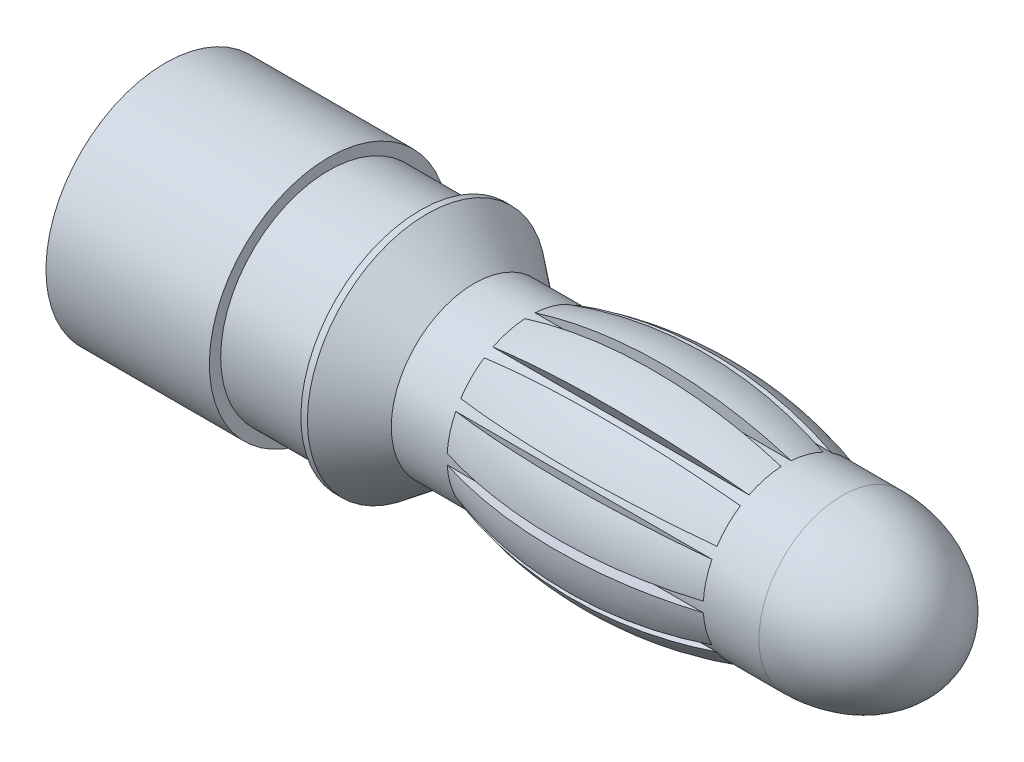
ISO-10303-21;
HEADER;
FILE_DESCRIPTION(('STEP AP214'),'2;1');
FILE_NAME('part.step','',(''),(''),'','','');
FILE_SCHEMA(('AUTOMOTIVE_DESIGN { 1 0 10303 214 1 1 1 1 }'));
ENDSEC;
DATA;
#1=APPLICATION_CONTEXT('core data for automotive mechanical design processes');
#2=APPLICATION_PROTOCOL_DEFINITION('international standard','automotive_design',2000,#1);
#3=PRODUCT_CONTEXT('',#1,'mechanical');
#4=PRODUCT('Part','Part','',(#3));
#5=PRODUCT_RELATED_PRODUCT_CATEGORY('part','',(#4));
#6=PRODUCT_DEFINITION_FORMATION('','',#4);
#7=PRODUCT_DEFINITION_CONTEXT('part definition',#1,'design');
#8=PRODUCT_DEFINITION('design','',#6,#7);
#9=PRODUCT_DEFINITION_SHAPE('','',#8);
#10=(LENGTH_UNIT() NAMED_UNIT(*) SI_UNIT(.MILLI.,.METRE.));
#11=(NAMED_UNIT(*) PLANE_ANGLE_UNIT() SI_UNIT($,.RADIAN.));
#12=(NAMED_UNIT(*) SI_UNIT($,.STERADIAN.) SOLID_ANGLE_UNIT());
#13=UNCERTAINTY_MEASURE_WITH_UNIT(LENGTH_MEASURE(1.E-05),#10,'distance_accuracy_value','');
#14=(GEOMETRIC_REPRESENTATION_CONTEXT(3) GLOBAL_UNCERTAINTY_ASSIGNED_CONTEXT((#13)) GLOBAL_UNIT_ASSIGNED_CONTEXT((#10,
#11,#12)) REPRESENTATION_CONTEXT('',''));
#15=CARTESIAN_POINT('',(0.,0.,0.));
#16=DIRECTION('',(0.,0.,1.));
#17=DIRECTION('',(1.,0.,0.));
#18=AXIS2_PLACEMENT_3D('',#15,#16,#17);
#19=CARTESIAN_POINT('',(12.3691559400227,2.35714252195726,-5.35011521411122E-07));
#20=CARTESIAN_POINT('',(12.3691559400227,2.35714252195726,4.71428517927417));
#21=CARTESIAN_POINT('',(12.3691559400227,-2.35714319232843,4.71428517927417));
#22=CARTESIAN_POINT('',(12.3691559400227,-2.35714319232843,-5.35011521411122E-07));
#23=CARTESIAN_POINT('',(12.3691559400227,-2.35714319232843,-4.71428624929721));
#24=CARTESIAN_POINT('',(12.3691559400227,2.35714252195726,-4.71428624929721));
#25=CARTESIAN_POINT('',(12.3691559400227,2.35714252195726,-5.35011521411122E-07));
#26=CARTESIAN_POINT('',(10.0061065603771,3.09922780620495,-5.35011521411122E-07));
#27=CARTESIAN_POINT('',(10.0061065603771,3.09922780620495,6.19845574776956));
#28=CARTESIAN_POINT('',(10.0061065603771,-3.09922847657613,6.19845574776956));
#29=CARTESIAN_POINT('',(10.0061065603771,-3.09922847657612,-5.35011521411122E-07));
#30=CARTESIAN_POINT('',(10.0061065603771,-3.09922847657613,-6.1984568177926));
#31=CARTESIAN_POINT('',(10.0061065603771,3.09922780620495,-6.1984568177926));
#32=CARTESIAN_POINT('',(10.0061065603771,3.09922780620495,-5.35011521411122E-07));
#33=CARTESIAN_POINT('',(7.45372151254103,3.09922780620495,-5.35011521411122E-07));
#34=CARTESIAN_POINT('',(7.45372151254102,3.09922780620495,6.19845574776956));
#35=CARTESIAN_POINT('',(7.45372151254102,-3.09922847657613,6.19845574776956));
#36=CARTESIAN_POINT('',(7.45372151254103,-3.09922847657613,-5.35011521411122E-07));
#37=CARTESIAN_POINT('',(7.45372151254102,-3.09922847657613,-6.1984568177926));
#38=CARTESIAN_POINT('',(7.45372151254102,3.09922780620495,-6.1984568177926));
#39=CARTESIAN_POINT('',(7.45372151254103,3.09922780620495,-5.35011521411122E-07));
#40=CARTESIAN_POINT('',(5.09067213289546,2.35714252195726,-5.35011521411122E-07));
#41=CARTESIAN_POINT('',(5.09067213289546,2.35714252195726,4.71428517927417));
#42=CARTESIAN_POINT('',(5.09067213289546,-2.35714319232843,4.71428517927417));
#43=CARTESIAN_POINT('',(5.09067213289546,-2.35714319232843,-5.35011521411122E-07));
#44=CARTESIAN_POINT('',(5.09067213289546,-2.35714319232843,-4.71428624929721));
#45=CARTESIAN_POINT('',(5.09067213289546,2.35714252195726,-4.71428624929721));
#46=CARTESIAN_POINT('',(5.09067213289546,2.35714252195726,-5.35011521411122E-07));
#47=(BOUNDED_SURFACE() B_SPLINE_SURFACE(3,3,((#19,#20,#21,#22,#23,#24,#25),(#26,#27,#28,#29,#30,
#31,#32),(#33,#34,#35,#36,#37,#38,#39),(#40,#41,#42,#43,#44,#45,#46)),.UNSPECIFIED.,.F.,.T.,
.F.) B_SPLINE_SURFACE_WITH_KNOTS((4,4),(4,3,4),(0.,1.),(0.,0.5,1.),
.UNSPECIFIED.) GEOMETRIC_REPRESENTATION_ITEM() RATIONAL_B_SPLINE_SURFACE(((1.,0.333333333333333,
0.333333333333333,1.,0.333333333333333,0.333333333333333,1.),(0.9505467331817,0.316848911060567,
0.316848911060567,0.9505467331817,0.316848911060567,0.316848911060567,0.9505467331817),
(0.9505467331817,0.316848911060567,0.316848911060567,0.9505467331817,0.316848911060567,
0.316848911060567,0.9505467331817),(1.,0.333333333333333,0.333333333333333,1.,0.333333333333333,
0.333333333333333,1.))) REPRESENTATION_ITEM('') SURFACE());
#48=CARTESIAN_POINT('',(5.09067213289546,-0.142857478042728,2.35280933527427));
#49=CARTESIAN_POINT('',(5.40706524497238,-0.142857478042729,2.45230681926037));
#50=CARTESIAN_POINT('',(5.72768665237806,-0.142857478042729,2.53806022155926));
#51=CARTESIAN_POINT('',(6.37480180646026,-0.142857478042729,2.68246682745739));
#52=CARTESIAN_POINT('',(6.7012921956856,-0.142857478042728,2.74113504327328));
#53=CARTESIAN_POINT('',(7.35779478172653,-0.142857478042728,2.83185174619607));
#54=CARTESIAN_POINT('',(7.68780561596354,-0.142857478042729,2.86391017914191));
#55=CARTESIAN_POINT('',(8.34947210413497,-0.142857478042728,2.90166234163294));
#56=CARTESIAN_POINT('',(8.6811283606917,-0.142857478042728,2.90734556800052));
#57=CARTESIAN_POINT('',(9.2964413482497,-0.142857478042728,2.89343295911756));
#58=CARTESIAN_POINT('',(9.58018270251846,-0.142857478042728,2.87733443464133));
#59=CARTESIAN_POINT('',(10.1459541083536,-0.142857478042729,2.82569306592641));
#60=CARTESIAN_POINT('',(10.4279838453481,-0.142857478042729,2.79014675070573));
#61=CARTESIAN_POINT('',(10.9894191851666,-0.142857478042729,2.69934841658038));
#62=CARTESIAN_POINT('',(11.268818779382,-0.142857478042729,2.64405906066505));
#63=CARTESIAN_POINT('',(11.8229083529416,-0.142857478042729,2.51349547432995));
#64=CARTESIAN_POINT('',(12.0975982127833,-0.142857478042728,2.43822073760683));
#65=CARTESIAN_POINT('',(12.3691559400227,-0.142857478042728,2.35280933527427));
#66=B_SPLINE_CURVE_WITH_KNOTS('',3,(#48,#49,#50,#51,#52,#53,#54,#55,#56,#57,#58,#59,#60,#61,#62,
#63,#64,#65),.UNSPECIFIED.,.F.,.F.,(4,2,2,2,2,2,2,2,4),(0.,0.994567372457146,1.98858283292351,
2.98222659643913,3.97626601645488,4.82821573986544,5.68031756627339,6.53403945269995,
7.38778296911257),.UNSPECIFIED.);
#67=CARTESIAN_POINT('',(5.09067213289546,-0.142857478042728,2.35280933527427));
#68=VERTEX_POINT('',#67);
#69=CARTESIAN_POINT('',(12.3691559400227,-0.142857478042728,2.35280933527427));
#70=VERTEX_POINT('',#69);
#71=EDGE_CURVE('E653',#68,#70,#66,.T.);
#72=CARTESIAN_POINT('',(5.09067213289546,-3.35185585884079E-07,-5.35011521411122E-07));
#73=DIRECTION('',(1.,0.,0.));
#74=DIRECTION('',(0.,0.,-1.));
#75=AXIS2_PLACEMENT_3D('',#72,#73,#74);
#76=CIRCLE('',#75,2.35714285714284);
#77=CARTESIAN_POINT('',(5.09067213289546,-1.05268735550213,2.10902115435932));
#78=VERTEX_POINT('',#77);
#79=EDGE_CURVE('E320',#68,#78,#76,.T.);
#80=CARTESIAN_POINT('',(12.3691559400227,-1.05268735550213,2.10902115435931));
#81=CARTESIAN_POINT('',(12.0527628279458,-1.10243609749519,2.19518850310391));
#82=CARTESIAN_POINT('',(11.7321414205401,-1.14531279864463,2.2694531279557));
#83=CARTESIAN_POINT('',(11.0850262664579,-1.2175161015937,2.39451291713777));
#84=CARTESIAN_POINT('',(10.7585358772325,-1.24685020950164,2.44532108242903));
#85=CARTESIAN_POINT('',(10.1020332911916,-1.29220856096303,2.52388405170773));
#86=CARTESIAN_POINT('',(9.7720224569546,-1.30823777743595,2.55164746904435));
#87=CARTESIAN_POINT('',(9.11035596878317,-1.32711385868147,2.58434180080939));
#88=CARTESIAN_POINT('',(8.77869971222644,-1.32995547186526,2.58926361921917));
#89=CARTESIAN_POINT('',(8.16338672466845,-1.32299916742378,2.57721494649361));
#90=CARTESIAN_POINT('',(7.87964537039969,-1.31494990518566,2.56327321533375));
#91=CARTESIAN_POINT('',(7.3138739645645,-1.28912922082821,2.51855047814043));
#92=CARTESIAN_POINT('',(7.03184422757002,-1.27135606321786,2.48776646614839));
#93=CARTESIAN_POINT('',(6.4704088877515,-1.22595689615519,2.40913280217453));
#94=CARTESIAN_POINT('',(6.19100929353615,-1.19831221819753,2.36125081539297));
#95=CARTESIAN_POINT('',(5.63691971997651,-1.13303042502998,2.24817943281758));
#96=CARTESIAN_POINT('',(5.36222986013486,-1.09539305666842,2.18298959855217));
#97=CARTESIAN_POINT('',(5.09067213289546,-1.05268735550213,2.10902115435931));
#98=B_SPLINE_CURVE_WITH_KNOTS('',3,(#80,#81,#82,#83,#84,#85,#86,#87,#88,#89,#90,#91,#92,#93,#94,
#95,#96,#97),.UNSPECIFIED.,.F.,.F.,(4,2,2,2,2,2,2,2,4),(0.,0.994567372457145,1.98858283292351,
2.98222659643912,3.97626601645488,4.82821573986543,5.68031756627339,6.53403945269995,
7.38778296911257),.UNSPECIFIED.);
#99=CARTESIAN_POINT('',(12.3691559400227,-1.05268735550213,2.10902115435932));
#100=VERTEX_POINT('',#99);
#101=EDGE_CURVE('E23',#100,#78,#98,.T.);
#102=CARTESIAN_POINT('',(12.3691559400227,-3.35185585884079E-07,-5.35011521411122E-07));
#103=DIRECTION('',(-1.,0.,0.));
#104=DIRECTION('',(0.,0.,1.));
#105=AXIS2_PLACEMENT_3D('',#102,#103,#104);
#106=CIRCLE('',#105,2.35714285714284);
#107=EDGE_CURVE('E184',#100,#70,#106,.T.);
#108=ORIENTED_EDGE('',*,*,#71,.F.);
#109=ORIENTED_EDGE('',*,*,#79,.T.);
#110=ORIENTED_EDGE('',*,*,#101,.F.);
#111=ORIENTED_EDGE('',*,*,#107,.T.);
#112=EDGE_LOOP('',(#108,#109,#110,#111));
#113=FACE_BOUND('',#112,.T.);
#114=ADVANCED_FACE('F17',(#113),#47,.T.);
#115=CARTESIAN_POINT('',(12.3691559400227,2.35714252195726,-5.35011521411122E-07));
#116=CARTESIAN_POINT('',(12.3691559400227,2.35714252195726,4.71428517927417));
#117=CARTESIAN_POINT('',(12.3691559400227,-2.35714319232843,4.71428517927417));
#118=CARTESIAN_POINT('',(12.3691559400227,-2.35714319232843,-5.35011521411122E-07));
#119=CARTESIAN_POINT('',(12.3691559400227,-2.35714319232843,-4.71428624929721));
#120=CARTESIAN_POINT('',(12.3691559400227,2.35714252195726,-4.71428624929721));
#121=CARTESIAN_POINT('',(12.3691559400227,2.35714252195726,-5.35011521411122E-07));
#122=CARTESIAN_POINT('',(10.0061065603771,3.09922780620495,-5.35011521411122E-07));
#123=CARTESIAN_POINT('',(10.0061065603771,3.09922780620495,6.19845574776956));
#124=CARTESIAN_POINT('',(10.0061065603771,-3.09922847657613,6.19845574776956));
#125=CARTESIAN_POINT('',(10.0061065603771,-3.09922847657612,-5.35011521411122E-07));
#126=CARTESIAN_POINT('',(10.0061065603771,-3.09922847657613,-6.1984568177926));
#127=CARTESIAN_POINT('',(10.0061065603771,3.09922780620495,-6.1984568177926));
#128=CARTESIAN_POINT('',(10.0061065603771,3.09922780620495,-5.35011521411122E-07));
#129=CARTESIAN_POINT('',(7.45372151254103,3.09922780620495,-5.35011521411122E-07));
#130=CARTESIAN_POINT('',(7.45372151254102,3.09922780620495,6.19845574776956));
#131=CARTESIAN_POINT('',(7.45372151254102,-3.09922847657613,6.19845574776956));
#132=CARTESIAN_POINT('',(7.45372151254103,-3.09922847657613,-5.35011521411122E-07));
#133=CARTESIAN_POINT('',(7.45372151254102,-3.09922847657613,-6.1984568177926));
#134=CARTESIAN_POINT('',(7.45372151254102,3.09922780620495,-6.1984568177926));
#135=CARTESIAN_POINT('',(7.45372151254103,3.09922780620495,-5.35011521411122E-07));
#136=CARTESIAN_POINT('',(5.09067213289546,2.35714252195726,-5.35011521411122E-07));
#137=CARTESIAN_POINT('',(5.09067213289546,2.35714252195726,4.71428517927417));
#138=CARTESIAN_POINT('',(5.09067213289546,-2.35714319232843,4.71428517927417));
#139=CARTESIAN_POINT('',(5.09067213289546,-2.35714319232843,-5.35011521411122E-07));
#140=CARTESIAN_POINT('',(5.09067213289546,-2.35714319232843,-4.71428624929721));
#141=CARTESIAN_POINT('',(5.09067213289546,2.35714252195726,-4.71428624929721));
#142=CARTESIAN_POINT('',(5.09067213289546,2.35714252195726,-5.35011521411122E-07));
#143=(BOUNDED_SURFACE() B_SPLINE_SURFACE(3,3,((#115,#116,#117,#118,#119,#120,#121),(#122,#123,
#124,#125,#126,#127,#128),(#129,#130,#131,#132,#133,#134,#135),(#136,#137,#138,#139,#140,#141,
#142)),.UNSPECIFIED.,.F.,.T.,.F.) B_SPLINE_SURFACE_WITH_KNOTS((4,4),(4,3,4),(0.,1.),(0.,0.5,1.),
.UNSPECIFIED.) GEOMETRIC_REPRESENTATION_ITEM() RATIONAL_B_SPLINE_SURFACE(((1.,0.333333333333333,
0.333333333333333,1.,0.333333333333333,0.333333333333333,1.),(0.9505467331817,0.316848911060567,
0.316848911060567,0.9505467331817,0.316848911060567,0.316848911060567,0.9505467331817),
(0.9505467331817,0.316848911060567,0.316848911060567,0.9505467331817,0.316848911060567,
0.316848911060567,0.9505467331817),(1.,0.333333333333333,0.333333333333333,1.,0.333333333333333,
0.333333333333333,1.))) REPRESENTATION_ITEM('') SURFACE());
#144=CARTESIAN_POINT('',(5.09067213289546,-2.35281020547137,-0.142857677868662));
#145=CARTESIAN_POINT('',(5.40706524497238,-2.45230768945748,-0.142857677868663));
#146=CARTESIAN_POINT('',(5.72768665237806,-2.53806109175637,-0.142857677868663));
#147=CARTESIAN_POINT('',(6.37480180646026,-2.6824676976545,-0.142857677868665));
#148=CARTESIAN_POINT('',(6.70129219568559,-2.74113591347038,-0.142857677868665));
#149=CARTESIAN_POINT('',(7.35779478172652,-2.83185261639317,-0.142857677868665));
#150=CARTESIAN_POINT('',(7.68780561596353,-2.86391104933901,-0.142857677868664));
#151=CARTESIAN_POINT('',(8.34947210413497,-2.90166321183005,-0.142857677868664));
#152=CARTESIAN_POINT('',(8.6811283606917,-2.90734643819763,-0.142857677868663));
#153=CARTESIAN_POINT('',(9.29644134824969,-2.89343382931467,-0.142857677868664));
#154=CARTESIAN_POINT('',(9.58018270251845,-2.87733530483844,-0.142857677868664));
#155=CARTESIAN_POINT('',(10.1459541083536,-2.82569393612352,-0.142857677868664));
#156=CARTESIAN_POINT('',(10.4279838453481,-2.79014762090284,-0.142857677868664));
#157=CARTESIAN_POINT('',(10.9894191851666,-2.69934928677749,-0.142857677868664));
#158=CARTESIAN_POINT('',(11.268818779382,-2.64405993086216,-0.142857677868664));
#159=CARTESIAN_POINT('',(11.8229083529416,-2.51349634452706,-0.142857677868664));
#160=CARTESIAN_POINT('',(12.0975982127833,-2.43822160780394,-0.142857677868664));
#161=CARTESIAN_POINT('',(12.3691559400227,-2.35281020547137,-0.142857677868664));
#162=B_SPLINE_CURVE_WITH_KNOTS('',3,(#144,#145,#146,#147,#148,#149,#150,#151,#152,#153,#154,
#155,#156,#157,#158,#159,#160,#161),.UNSPECIFIED.,.F.,.F.,(4,2,2,2,2,2,2,2,4),(0.,
0.994567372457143,1.9885828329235,2.98222659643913,3.97626601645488,4.82821573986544,
5.68031756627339,6.53403945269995,7.38778296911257),.UNSPECIFIED.);
#163=CARTESIAN_POINT('',(5.09067213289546,-2.35281020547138,-0.142857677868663));
#164=VERTEX_POINT('',#163);
#165=CARTESIAN_POINT('',(12.3691559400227,-2.35281020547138,-0.142857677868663));
#166=VERTEX_POINT('',#165);
#167=EDGE_CURVE('E641',#164,#166,#162,.T.);
#168=CARTESIAN_POINT('',(5.09067213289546,-3.35185585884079E-07,-5.35011521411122E-07));
#169=DIRECTION('',(1.,0.,0.));
#170=DIRECTION('',(0.,0.,-1.));
#171=AXIS2_PLACEMENT_3D('',#168,#169,#170);
#172=CIRCLE('',#171,2.35714285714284);
#173=CARTESIAN_POINT('',(5.09067213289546,-2.10902202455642,-1.05268755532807));
#174=VERTEX_POINT('',#173);
#175=EDGE_CURVE('E316',#164,#174,#172,.T.);
#176=CARTESIAN_POINT('',(12.3691559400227,-2.10902202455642,-1.05268755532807));
#177=CARTESIAN_POINT('',(12.0527628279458,-2.1951893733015,-1.10243629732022));
#178=CARTESIAN_POINT('',(11.7321414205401,-2.26945399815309,-1.14531299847));
#179=CARTESIAN_POINT('',(11.085026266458,-2.39451378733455,-1.21751630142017));
#180=CARTESIAN_POINT('',(10.7585358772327,-2.4453219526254,-1.24685040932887));
#181=CARTESIAN_POINT('',(10.1020332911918,-2.52388492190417,-1.29220876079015));
#182=CARTESIAN_POINT('',(9.77202245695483,-2.55164833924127,-1.3082379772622));
#183=CARTESIAN_POINT('',(9.11035596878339,-2.58434267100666,-1.32711405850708));
#184=CARTESIAN_POINT('',(8.77869971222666,-2.58926448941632,-1.32995567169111));
#185=CARTESIAN_POINT('',(8.16338672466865,-2.57721581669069,-1.32299936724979));
#186=CARTESIAN_POINT('',(7.87964537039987,-2.56327408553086,-1.31495010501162));
#187=CARTESIAN_POINT('',(7.31387396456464,-2.51855134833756,-1.28912942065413));
#188=CARTESIAN_POINT('',(7.03184422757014,-2.48776733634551,-1.2713562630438));
#189=CARTESIAN_POINT('',(6.47040888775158,-2.40913367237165,-1.22595709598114));
#190=CARTESIAN_POINT('',(6.19100929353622,-2.36125168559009,-1.19831241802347));
#191=CARTESIAN_POINT('',(5.63691971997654,-2.2481803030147,-1.13303062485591));
#192=CARTESIAN_POINT('',(5.36222986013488,-2.18299046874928,-1.09539325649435));
#193=CARTESIAN_POINT('',(5.09067213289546,-2.10902202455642,-1.05268755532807));
#194=B_SPLINE_CURVE_WITH_KNOTS('',3,(#176,#177,#178,#179,#180,#181,#182,#183,#184,#185,#186,
#187,#188,#189,#190,#191,#192,#193),.UNSPECIFIED.,.F.,.F.,(4,2,2,2,2,2,2,2,4),(0.,
0.994567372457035,1.98858283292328,2.9822265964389,3.97626601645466,4.82821573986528,
5.68031756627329,6.5340394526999,7.38778296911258),.UNSPECIFIED.);
#195=CARTESIAN_POINT('',(12.3691559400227,-2.10902202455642,-1.05268755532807));
#196=VERTEX_POINT('',#195);
#197=EDGE_CURVE('E647',#196,#174,#194,.T.);
#198=CARTESIAN_POINT('',(12.3691559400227,-3.35185585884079E-07,-5.35011521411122E-07));
#199=DIRECTION('',(-1.,0.,0.));
#200=DIRECTION('',(0.,0.,1.));
#201=AXIS2_PLACEMENT_3D('',#198,#199,#200);
#202=CIRCLE('',#201,2.35714285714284);
#203=EDGE_CURVE('E318',#196,#166,#202,.T.);
#204=ORIENTED_EDGE('',*,*,#167,.F.);
#205=ORIENTED_EDGE('',*,*,#175,.T.);
#206=ORIENTED_EDGE('',*,*,#197,.F.);
#207=ORIENTED_EDGE('',*,*,#203,.T.);
#208=EDGE_LOOP('',(#204,#205,#206,#207));
#209=FACE_BOUND('',#208,.T.);
#210=ADVANCED_FACE('F622',(#209),#143,.T.);
#211=CARTESIAN_POINT('',(12.3691559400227,2.35714252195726,-5.35011521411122E-07));
#212=CARTESIAN_POINT('',(12.3691559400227,2.35714252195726,4.71428517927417));
#213=CARTESIAN_POINT('',(12.3691559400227,-2.35714319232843,4.71428517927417));
#214=CARTESIAN_POINT('',(12.3691559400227,-2.35714319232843,-5.35011521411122E-07));
#215=CARTESIAN_POINT('',(12.3691559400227,-2.35714319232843,-4.71428624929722));
#216=CARTESIAN_POINT('',(12.3691559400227,2.35714252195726,-4.71428624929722));
#217=CARTESIAN_POINT('',(12.3691559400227,2.35714252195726,-5.35011521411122E-07));
#218=CARTESIAN_POINT('',(10.0061065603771,3.09922780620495,-5.35011521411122E-07));
#219=CARTESIAN_POINT('',(10.0061065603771,3.09922780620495,6.19845574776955));
#220=CARTESIAN_POINT('',(10.0061065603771,-3.09922847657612,6.19845574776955));
#221=CARTESIAN_POINT('',(10.0061065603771,-3.09922847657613,-5.35011521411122E-07));
#222=CARTESIAN_POINT('',(10.0061065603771,-3.09922847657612,-6.1984568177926));
#223=CARTESIAN_POINT('',(10.0061065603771,3.09922780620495,-6.1984568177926));
#224=CARTESIAN_POINT('',(10.0061065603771,3.09922780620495,-5.35011521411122E-07));
#225=CARTESIAN_POINT('',(7.45372151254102,3.09922780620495,-5.35011521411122E-07));
#226=CARTESIAN_POINT('',(7.45372151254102,3.09922780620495,6.19845574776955));
#227=CARTESIAN_POINT('',(7.45372151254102,-3.09922847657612,6.19845574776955));
#228=CARTESIAN_POINT('',(7.45372151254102,-3.09922847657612,-5.35011521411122E-07));
#229=CARTESIAN_POINT('',(7.45372151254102,-3.09922847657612,-6.1984568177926));
#230=CARTESIAN_POINT('',(7.45372151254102,3.09922780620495,-6.1984568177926));
#231=CARTESIAN_POINT('',(7.45372151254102,3.09922780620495,-5.35011521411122E-07));
#232=CARTESIAN_POINT('',(5.09067213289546,2.35714252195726,-5.35011521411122E-07));
#233=CARTESIAN_POINT('',(5.09067213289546,2.35714252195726,4.71428517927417));
#234=CARTESIAN_POINT('',(5.09067213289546,-2.35714319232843,4.71428517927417));
#235=CARTESIAN_POINT('',(5.09067213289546,-2.35714319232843,-5.35011521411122E-07));
#236=CARTESIAN_POINT('',(5.09067213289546,-2.35714319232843,-4.71428624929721));
#237=CARTESIAN_POINT('',(5.09067213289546,2.35714252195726,-4.71428624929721));
#238=CARTESIAN_POINT('',(5.09067213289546,2.35714252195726,-5.35011521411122E-07));
#239=(BOUNDED_SURFACE() B_SPLINE_SURFACE(3,3,((#211,#212,#213,#214,#215,#216,#217),(#218,#219,
#220,#221,#222,#223,#224),(#225,#226,#227,#228,#229,#230,#231),(#232,#233,#234,#235,#236,#237,
#238)),.UNSPECIFIED.,.F.,.T.,.F.) B_SPLINE_SURFACE_WITH_KNOTS((4,4),(4,3,4),(0.,1.),(0.,0.5,1.),
.UNSPECIFIED.) GEOMETRIC_REPRESENTATION_ITEM() RATIONAL_B_SPLINE_SURFACE(((1.,0.333333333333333,
0.333333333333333,1.,0.333333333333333,0.333333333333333,1.),(0.9505467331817,0.316848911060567,
0.316848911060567,0.9505467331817,0.316848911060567,0.316848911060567,0.9505467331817),
(0.9505467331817,0.316848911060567,0.316848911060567,0.9505467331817,0.316848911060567,
0.316848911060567,0.9505467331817),(1.,0.333333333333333,0.333333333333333,1.,0.333333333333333,
0.333333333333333,1.))) REPRESENTATION_ITEM('') SURFACE());
#240=CARTESIAN_POINT('',(5.09067213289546,-2.10902202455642,1.05268648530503));
#241=CARTESIAN_POINT('',(5.40706524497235,-2.1951893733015,1.10243522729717));
#242=CARTESIAN_POINT('',(5.72768665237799,-2.26945399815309,1.14531192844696));
#243=CARTESIAN_POINT('',(6.37480180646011,-2.39451378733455,1.21751523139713));
#244=CARTESIAN_POINT('',(6.70129219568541,-2.4453219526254,1.24684933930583));
#245=CARTESIAN_POINT('',(7.3577947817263,-2.52388492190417,1.29220769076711));
#246=CARTESIAN_POINT('',(7.68780561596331,-2.55164833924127,1.30823690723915));
#247=CARTESIAN_POINT('',(8.34947210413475,-2.58434267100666,1.32711298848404));
#248=CARTESIAN_POINT('',(8.68112836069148,-2.58926448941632,1.32995460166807));
#249=CARTESIAN_POINT('',(9.29644134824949,-2.57721581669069,1.32299829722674));
#250=CARTESIAN_POINT('',(9.58018270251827,-2.56327408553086,1.31494903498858));
#251=CARTESIAN_POINT('',(10.1459541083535,-2.51855134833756,1.28912835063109));
#252=CARTESIAN_POINT('',(10.427983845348,-2.48776733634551,1.27135519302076));
#253=CARTESIAN_POINT('',(10.9894191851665,-2.40913367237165,1.2259560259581));
#254=CARTESIAN_POINT('',(11.2688187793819,-2.3612516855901,1.19831134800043));
#255=CARTESIAN_POINT('',(11.8229083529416,-2.2481803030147,1.13302955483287));
#256=CARTESIAN_POINT('',(12.0975982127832,-2.18299046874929,1.09539218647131));
#257=CARTESIAN_POINT('',(12.3691559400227,-2.10902202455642,1.05268648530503));
#258=B_SPLINE_CURVE_WITH_KNOTS('',3,(#240,#241,#242,#243,#244,#245,#246,#247,#248,#249,#250,
#251,#252,#253,#254,#255,#256,#257),.UNSPECIFIED.,.F.,.F.,(4,2,2,2,2,2,2,2,4),(0.,
0.994567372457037,1.98858283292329,2.98222659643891,3.97626601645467,4.82821573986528,
5.68031756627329,6.5340394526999,7.38778296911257),.UNSPECIFIED.);
#259=CARTESIAN_POINT('',(5.09067213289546,-2.10902202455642,1.05268648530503));
#260=VERTEX_POINT('',#259);
#261=CARTESIAN_POINT('',(12.3691559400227,-2.10902202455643,1.05268648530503));
#262=VERTEX_POINT('',#261);
#263=EDGE_CURVE('E606',#260,#262,#258,.T.);
#264=CARTESIAN_POINT('',(5.09067213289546,-3.35185585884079E-07,-5.35011521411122E-07));
#265=DIRECTION('',(1.,0.,0.));
#266=DIRECTION('',(0.,0.,-1.));
#267=AXIS2_PLACEMENT_3D('',#264,#265,#266);
#268=CIRCLE('',#267,2.35714285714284);
#269=CARTESIAN_POINT('',(5.09067213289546,-2.35281020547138,0.142856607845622));
#270=VERTEX_POINT('',#269);
#271=EDGE_CURVE('E312',#260,#270,#268,.T.);
#272=CARTESIAN_POINT('',(12.3691559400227,-2.35281020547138,0.142856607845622));
#273=CARTESIAN_POINT('',(12.0527628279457,-2.45230768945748,0.142856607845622));
#274=CARTESIAN_POINT('',(11.7321414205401,-2.53806109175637,0.142856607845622));
#275=CARTESIAN_POINT('',(11.0850262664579,-2.6824676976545,0.142856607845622));
#276=CARTESIAN_POINT('',(10.7585358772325,-2.74113591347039,0.142856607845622));
#277=CARTESIAN_POINT('',(10.1020332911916,-2.83185261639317,0.142856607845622));
#278=CARTESIAN_POINT('',(9.7720224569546,-2.86391104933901,0.142856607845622));
#279=CARTESIAN_POINT('',(9.11035596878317,-2.90166321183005,0.142856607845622));
#280=CARTESIAN_POINT('',(8.77869971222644,-2.90734643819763,0.142856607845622));
#281=CARTESIAN_POINT('',(8.16338672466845,-2.89343382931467,0.142856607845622));
#282=CARTESIAN_POINT('',(7.87964537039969,-2.87733530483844,0.142856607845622));
#283=CARTESIAN_POINT('',(7.3138739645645,-2.82569393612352,0.142856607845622));
#284=CARTESIAN_POINT('',(7.03184422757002,-2.79014762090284,0.142856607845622));
#285=CARTESIAN_POINT('',(6.4704088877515,-2.69934928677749,0.142856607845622));
#286=CARTESIAN_POINT('',(6.19100929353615,-2.64405993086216,0.142856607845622));
#287=CARTESIAN_POINT('',(5.63691971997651,-2.51349634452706,0.142856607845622));
#288=CARTESIAN_POINT('',(5.36222986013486,-2.43822160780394,0.142856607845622));
#289=CARTESIAN_POINT('',(5.09067213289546,-2.35281020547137,0.142856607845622));
#290=B_SPLINE_CURVE_WITH_KNOTS('',3,(#272,#273,#274,#275,#276,#277,#278,#279,#280,#281,#282,
#283,#284,#285,#286,#287,#288,#289),.UNSPECIFIED.,.F.,.F.,(4,2,2,2,2,2,2,2,4),(0.,
0.994567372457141,1.9885828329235,2.98222659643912,3.97626601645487,4.82821573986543,
5.68031756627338,6.53403945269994,7.38778296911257),.UNSPECIFIED.);
#291=CARTESIAN_POINT('',(12.3691559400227,-2.35281020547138,0.142856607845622));
#292=VERTEX_POINT('',#291);
#293=EDGE_CURVE('E612',#292,#270,#290,.T.);
#294=CARTESIAN_POINT('',(12.3691559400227,-3.35185585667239E-07,-5.35011521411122E-07));
#295=DIRECTION('',(-1.,0.,0.));
#296=DIRECTION('',(0.,0.,1.));
#297=AXIS2_PLACEMENT_3D('',#294,#295,#296);
#298=CIRCLE('',#297,2.35714285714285);
#299=EDGE_CURVE('E314',#292,#262,#298,.T.);
#300=ORIENTED_EDGE('',*,*,#263,.F.);
#301=ORIENTED_EDGE('',*,*,#271,.T.);
#302=ORIENTED_EDGE('',*,*,#293,.F.);
#303=ORIENTED_EDGE('',*,*,#299,.T.);
#304=EDGE_LOOP('',(#300,#301,#302,#303));
#305=FACE_BOUND('',#304,.T.);
#306=ADVANCED_FACE('F617',(#305),#239,.T.);
#307=CARTESIAN_POINT('',(12.3691559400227,2.35714252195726,-5.35011521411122E-07));
#308=CARTESIAN_POINT('',(12.3691559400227,2.35714252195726,4.71428517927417));
#309=CARTESIAN_POINT('',(12.3691559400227,-2.35714319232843,4.71428517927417));
#310=CARTESIAN_POINT('',(12.3691559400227,-2.35714319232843,-5.35011521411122E-07));
#311=CARTESIAN_POINT('',(12.3691559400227,-2.35714319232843,-4.71428624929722));
#312=CARTESIAN_POINT('',(12.3691559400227,2.35714252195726,-4.71428624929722));
#313=CARTESIAN_POINT('',(12.3691559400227,2.35714252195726,-5.35011521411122E-07));
#314=CARTESIAN_POINT('',(10.0061065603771,3.09922780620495,-5.35011521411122E-07));
#315=CARTESIAN_POINT('',(10.0061065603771,3.09922780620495,6.19845574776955));
#316=CARTESIAN_POINT('',(10.0061065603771,-3.09922847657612,6.19845574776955));
#317=CARTESIAN_POINT('',(10.0061065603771,-3.09922847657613,-5.35011521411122E-07));
#318=CARTESIAN_POINT('',(10.0061065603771,-3.09922847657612,-6.1984568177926));
#319=CARTESIAN_POINT('',(10.0061065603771,3.09922780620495,-6.1984568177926));
#320=CARTESIAN_POINT('',(10.0061065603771,3.09922780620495,-5.35011521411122E-07));
#321=CARTESIAN_POINT('',(7.45372151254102,3.09922780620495,-5.35011521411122E-07));
#322=CARTESIAN_POINT('',(7.45372151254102,3.09922780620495,6.19845574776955));
#323=CARTESIAN_POINT('',(7.45372151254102,-3.09922847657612,6.19845574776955));
#324=CARTESIAN_POINT('',(7.45372151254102,-3.09922847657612,-5.35011521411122E-07));
#325=CARTESIAN_POINT('',(7.45372151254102,-3.09922847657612,-6.1984568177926));
#326=CARTESIAN_POINT('',(7.45372151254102,3.09922780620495,-6.1984568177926));
#327=CARTESIAN_POINT('',(7.45372151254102,3.09922780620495,-5.35011521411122E-07));
#328=CARTESIAN_POINT('',(5.09067213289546,2.35714252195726,-5.35011521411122E-07));
#329=CARTESIAN_POINT('',(5.09067213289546,2.35714252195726,4.71428517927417));
#330=CARTESIAN_POINT('',(5.09067213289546,-2.35714319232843,4.71428517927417));
#331=CARTESIAN_POINT('',(5.09067213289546,-2.35714319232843,-5.35011521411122E-07));
#332=CARTESIAN_POINT('',(5.09067213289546,-2.35714319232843,-4.71428624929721));
#333=CARTESIAN_POINT('',(5.09067213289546,2.35714252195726,-4.71428624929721));
#334=CARTESIAN_POINT('',(5.09067213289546,2.35714252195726,-5.35011521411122E-07));
#335=(BOUNDED_SURFACE() B_SPLINE_SURFACE(3,3,((#307,#308,#309,#310,#311,#312,#313),(#314,#315,
#316,#317,#318,#319,#320),(#321,#322,#323,#324,#325,#326,#327),(#328,#329,#330,#331,#332,#333,
#334)),.UNSPECIFIED.,.F.,.T.,.F.) B_SPLINE_SURFACE_WITH_KNOTS((4,4),(4,3,4),(0.,1.),(0.,0.5,1.),
.UNSPECIFIED.) GEOMETRIC_REPRESENTATION_ITEM() RATIONAL_B_SPLINE_SURFACE(((1.,0.333333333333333,
0.333333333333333,1.,0.333333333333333,0.333333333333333,1.),(0.9505467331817,0.316848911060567,
0.316848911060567,0.9505467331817,0.316848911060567,0.316848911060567,0.9505467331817),
(0.9505467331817,0.316848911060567,0.316848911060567,0.9505467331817,0.316848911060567,
0.316848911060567,0.9505467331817),(1.,0.333333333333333,0.333333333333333,1.,0.333333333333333,
0.333333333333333,1.))) REPRESENTATION_ITEM('') SURFACE());
#336=CARTESIAN_POINT('',(12.3691559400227,-1.96616488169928,1.30012231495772));
#337=CARTESIAN_POINT('',(12.0527628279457,-2.05233223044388,1.34987105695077));
#338=CARTESIAN_POINT('',(11.7321414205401,-2.12659685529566,1.39274775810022));
#339=CARTESIAN_POINT('',(11.0850262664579,-2.25165664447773,1.46495106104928));
#340=CARTESIAN_POINT('',(10.7585358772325,-2.302464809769,1.49428516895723));
#341=CARTESIAN_POINT('',(10.1020332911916,-2.3810277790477,1.53964352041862));
#342=CARTESIAN_POINT('',(9.77202245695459,-2.40879119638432,1.55567273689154));
#343=CARTESIAN_POINT('',(9.11035596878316,-2.44148552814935,1.57454881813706));
#344=CARTESIAN_POINT('',(8.77869971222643,-2.44640734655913,1.57739043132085));
#345=CARTESIAN_POINT('',(8.16338672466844,-2.43435867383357,1.57043412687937));
#346=CARTESIAN_POINT('',(7.87964537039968,-2.42041694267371,1.56238486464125));
#347=CARTESIAN_POINT('',(7.3138739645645,-2.37569420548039,1.53656418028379));
#348=CARTESIAN_POINT('',(7.03184422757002,-2.34491019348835,1.51879102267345));
#349=CARTESIAN_POINT('',(6.4704088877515,-2.2662765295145,1.47339185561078));
#350=CARTESIAN_POINT('',(6.19100929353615,-2.21839454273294,1.44574717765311));
#351=CARTESIAN_POINT('',(5.63691971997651,-2.10532316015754,1.38046538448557));
#352=CARTESIAN_POINT('',(5.36222986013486,-2.04013332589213,1.342828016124));
#353=CARTESIAN_POINT('',(5.09067213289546,-1.96616488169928,1.30012231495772));
#354=B_SPLINE_CURVE_WITH_KNOTS('',3,(#336,#337,#338,#339,#340,#341,#342,#343,#344,#345,#346,
#347,#348,#349,#350,#351,#352,#353),.UNSPECIFIED.,.F.,.F.,(4,2,2,2,2,2,2,2,4),(0.,
0.994567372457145,1.9885828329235,2.98222659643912,3.97626601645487,4.82821573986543,
5.68031756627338,6.53403945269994,7.38778296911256),.UNSPECIFIED.);
#355=CARTESIAN_POINT('',(12.3691559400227,-1.96616488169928,1.30012231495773));
#356=VERTEX_POINT('',#355);
#357=CARTESIAN_POINT('',(5.09067213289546,-1.96616488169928,1.30012231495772));
#358=VERTEX_POINT('',#357);
#359=EDGE_CURVE('E600',#356,#358,#354,.T.);
#360=CARTESIAN_POINT('',(12.3691559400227,-3.35185585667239E-07,-5.35011521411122E-07));
#361=DIRECTION('',(-1.,0.,0.));
#362=DIRECTION('',(0.,0.,1.));
#363=AXIS2_PLACEMENT_3D('',#360,#361,#362);
#364=CIRCLE('',#363,2.35714285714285);
#365=CARTESIAN_POINT('',(12.3691559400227,-1.30012318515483,1.96616401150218));
#366=VERTEX_POINT('',#365);
#367=EDGE_CURVE('E308',#356,#366,#364,.T.);
#368=CARTESIAN_POINT('',(5.09067213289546,-1.30012318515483,1.96616401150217));
#369=CARTESIAN_POINT('',(5.40706524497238,-1.34987192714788,2.05233136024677));
#370=CARTESIAN_POINT('',(5.72768665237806,-1.39274862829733,2.12659598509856));
#371=CARTESIAN_POINT('',(6.37480180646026,-1.46495193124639,2.25165577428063));
#372=CARTESIAN_POINT('',(6.70129219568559,-1.49428603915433,2.30246393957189));
#373=CARTESIAN_POINT('',(7.35779478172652,-1.53964439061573,2.38102690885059));
#374=CARTESIAN_POINT('',(7.68780561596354,-1.55567360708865,2.40879032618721));
#375=CARTESIAN_POINT('',(8.34947210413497,-1.57454968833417,2.44148465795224));
#376=CARTESIAN_POINT('',(8.6811283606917,-1.57739130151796,2.44640647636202));
#377=CARTESIAN_POINT('',(9.29644134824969,-1.57043499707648,2.43435780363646));
#378=CARTESIAN_POINT('',(9.58018270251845,-1.56238573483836,2.4204160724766));
#379=CARTESIAN_POINT('',(10.1459541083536,-1.5365650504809,2.37569333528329));
#380=CARTESIAN_POINT('',(10.4279838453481,-1.51879189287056,2.34490932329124));
#381=CARTESIAN_POINT('',(10.9894191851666,-1.47339272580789,2.26627565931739));
#382=CARTESIAN_POINT('',(11.268818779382,-1.44574804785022,2.21839367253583));
#383=CARTESIAN_POINT('',(11.8229083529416,-1.38046625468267,2.10532228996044));
#384=CARTESIAN_POINT('',(12.0975982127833,-1.34282888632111,2.04013245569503));
#385=CARTESIAN_POINT('',(12.3691559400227,-1.30012318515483,1.96616401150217));
#386=B_SPLINE_CURVE_WITH_KNOTS('',3,(#368,#369,#370,#371,#372,#373,#374,#375,#376,#377,#378,
#379,#380,#381,#382,#383,#384,#385),.UNSPECIFIED.,.F.,.F.,(4,2,2,2,2,2,2,2,4),(0.,
0.994567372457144,1.9885828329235,2.98222659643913,3.97626601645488,4.82821573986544,
5.68031756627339,6.53403945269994,7.38778296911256),.UNSPECIFIED.);
#387=CARTESIAN_POINT('',(5.09067213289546,-1.30012318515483,1.96616401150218));
#388=VERTEX_POINT('',#387);
#389=EDGE_CURVE('E575',#388,#366,#386,.T.);
#390=CARTESIAN_POINT('',(5.09067213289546,-3.35185585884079E-07,-5.35011521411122E-07));
#391=DIRECTION('',(1.,0.,0.));
#392=DIRECTION('',(0.,0.,-1.));
#393=AXIS2_PLACEMENT_3D('',#390,#391,#392);
#394=CIRCLE('',#393,2.35714285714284);
#395=EDGE_CURVE('E310',#388,#358,#394,.T.);
#396=ORIENTED_EDGE('',*,*,#359,.F.);
#397=ORIENTED_EDGE('',*,*,#367,.T.);
#398=ORIENTED_EDGE('',*,*,#389,.F.);
#399=ORIENTED_EDGE('',*,*,#395,.T.);
#400=EDGE_LOOP('',(#396,#397,#398,#399));
#401=FACE_BOUND('',#400,.T.);
#402=ADVANCED_FACE('F550',(#401),#335,.T.);
#403=CARTESIAN_POINT('',(12.3691559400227,2.35714252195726,-5.35011521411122E-07));
#404=CARTESIAN_POINT('',(12.3691559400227,2.35714252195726,4.71428517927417));
#405=CARTESIAN_POINT('',(12.3691559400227,-2.35714319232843,4.71428517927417));
#406=CARTESIAN_POINT('',(12.3691559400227,-2.35714319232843,-5.35011521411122E-07));
#407=CARTESIAN_POINT('',(12.3691559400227,-2.35714319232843,-4.71428624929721));
#408=CARTESIAN_POINT('',(12.3691559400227,2.35714252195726,-4.71428624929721));
#409=CARTESIAN_POINT('',(12.3691559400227,2.35714252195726,-5.35011521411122E-07));
#410=CARTESIAN_POINT('',(10.0061065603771,3.09922780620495,-5.35011521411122E-07));
#411=CARTESIAN_POINT('',(10.0061065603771,3.09922780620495,6.19845574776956));
#412=CARTESIAN_POINT('',(10.0061065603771,-3.09922847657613,6.19845574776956));
#413=CARTESIAN_POINT('',(10.0061065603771,-3.09922847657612,-5.35011521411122E-07));
#414=CARTESIAN_POINT('',(10.0061065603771,-3.09922847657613,-6.1984568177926));
#415=CARTESIAN_POINT('',(10.0061065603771,3.09922780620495,-6.1984568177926));
#416=CARTESIAN_POINT('',(10.0061065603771,3.09922780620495,-5.35011521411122E-07));
#417=CARTESIAN_POINT('',(7.45372151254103,3.09922780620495,-5.35011521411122E-07));
#418=CARTESIAN_POINT('',(7.45372151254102,3.09922780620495,6.19845574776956));
#419=CARTESIAN_POINT('',(7.45372151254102,-3.09922847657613,6.19845574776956));
#420=CARTESIAN_POINT('',(7.45372151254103,-3.09922847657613,-5.35011521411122E-07));
#421=CARTESIAN_POINT('',(7.45372151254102,-3.09922847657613,-6.1984568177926));
#422=CARTESIAN_POINT('',(7.45372151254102,3.09922780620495,-6.1984568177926));
#423=CARTESIAN_POINT('',(7.45372151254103,3.09922780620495,-5.35011521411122E-07));
#424=CARTESIAN_POINT('',(5.09067213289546,2.35714252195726,-5.35011521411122E-07));
#425=CARTESIAN_POINT('',(5.09067213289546,2.35714252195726,4.71428517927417));
#426=CARTESIAN_POINT('',(5.09067213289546,-2.35714319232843,4.71428517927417));
#427=CARTESIAN_POINT('',(5.09067213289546,-2.35714319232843,-5.35011521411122E-07));
#428=CARTESIAN_POINT('',(5.09067213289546,-2.35714319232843,-4.71428624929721));
#429=CARTESIAN_POINT('',(5.09067213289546,2.35714252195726,-4.71428624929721));
#430=CARTESIAN_POINT('',(5.09067213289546,2.35714252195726,-5.35011521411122E-07));
#431=(BOUNDED_SURFACE() B_SPLINE_SURFACE(3,3,((#403,#404,#405,#406,#407,#408,#409),(#410,#411,
#412,#413,#414,#415,#416),(#417,#418,#419,#420,#421,#422,#423),(#424,#425,#426,#427,#428,#429,
#430)),.UNSPECIFIED.,.F.,.T.,.F.) B_SPLINE_SURFACE_WITH_KNOTS((4,4),(4,3,4),(0.,1.),(0.,0.5,1.),
.UNSPECIFIED.) GEOMETRIC_REPRESENTATION_ITEM() RATIONAL_B_SPLINE_SURFACE(((1.,0.333333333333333,
0.333333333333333,1.,0.333333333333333,0.333333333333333,1.),(0.9505467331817,0.316848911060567,
0.316848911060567,0.9505467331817,0.316848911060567,0.316848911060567,0.9505467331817),
(0.9505467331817,0.316848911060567,0.316848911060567,0.9505467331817,0.316848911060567,
0.316848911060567,0.9505467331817),(1.,0.333333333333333,0.333333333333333,1.,0.333333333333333,
0.333333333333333,1.))) REPRESENTATION_ITEM('') SURFACE());
#432=CARTESIAN_POINT('',(5.09067213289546,-1.05268735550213,-2.10902222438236));
#433=CARTESIAN_POINT('',(5.40706524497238,-1.10243609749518,-2.19518957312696));
#434=CARTESIAN_POINT('',(5.72768665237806,-1.14531279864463,-2.26945419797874));
#435=CARTESIAN_POINT('',(6.37480180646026,-1.2175161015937,-2.39451398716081));
#436=CARTESIAN_POINT('',(6.70129219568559,-1.24685020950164,-2.44532215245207));
#437=CARTESIAN_POINT('',(7.35779478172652,-1.29220856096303,-2.52388512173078));
#438=CARTESIAN_POINT('',(7.68780561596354,-1.30823777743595,-2.55164853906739));
#439=CARTESIAN_POINT('',(8.34947210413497,-1.32711385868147,-2.58434287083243));
#440=CARTESIAN_POINT('',(8.6811283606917,-1.32995547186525,-2.58926468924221));
#441=CARTESIAN_POINT('',(9.29644134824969,-1.32299916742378,-2.57721601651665));
#442=CARTESIAN_POINT('',(9.58018270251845,-1.31494990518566,-2.56327428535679));
#443=CARTESIAN_POINT('',(10.1459541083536,-1.2891292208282,-2.51855154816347));
#444=CARTESIAN_POINT('',(10.4279838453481,-1.27135606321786,-2.48776753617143));
#445=CARTESIAN_POINT('',(10.9894191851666,-1.22595689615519,-2.40913387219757));
#446=CARTESIAN_POINT('',(11.268818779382,-1.19831221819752,-2.36125188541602));
#447=CARTESIAN_POINT('',(11.8229083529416,-1.13303042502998,-2.24818050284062));
#448=CARTESIAN_POINT('',(12.0975982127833,-1.09539305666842,-2.18299066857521));
#449=CARTESIAN_POINT('',(12.3691559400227,-1.05268735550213,-2.10902222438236));
#450=B_SPLINE_CURVE_WITH_KNOTS('',3,(#432,#433,#434,#435,#436,#437,#438,#439,#440,#441,#442,
#443,#444,#445,#446,#447,#448,#449),.UNSPECIFIED.,.F.,.F.,(4,2,2,2,2,2,2,2,4),(0.,
0.994567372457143,1.9885828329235,2.98222659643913,3.97626601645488,4.82821573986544,
5.68031756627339,6.53403945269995,7.38778296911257),.UNSPECIFIED.);
#451=CARTESIAN_POINT('',(5.09067213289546,-1.05268735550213,-2.10902222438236));
#452=VERTEX_POINT('',#451);
#453=CARTESIAN_POINT('',(12.3691559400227,-1.05268735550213,-2.10902222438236));
#454=VERTEX_POINT('',#453);
#455=EDGE_CURVE('E562',#452,#454,#450,.T.);
#456=CARTESIAN_POINT('',(5.09067213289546,-3.35185585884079E-07,-5.35011521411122E-07));
#457=DIRECTION('',(1.,0.,0.));
#458=DIRECTION('',(0.,0.,-1.));
#459=AXIS2_PLACEMENT_3D('',#456,#457,#458);
#460=CIRCLE('',#459,2.35714285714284);
#461=CARTESIAN_POINT('',(5.09067213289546,-0.14285747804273,-2.35281040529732));
#462=VERTEX_POINT('',#461);
#463=EDGE_CURVE('E304',#452,#462,#460,.T.);
#464=CARTESIAN_POINT('',(12.3691559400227,-0.14285747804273,-2.35281040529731));
#465=CARTESIAN_POINT('',(12.0527628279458,-0.142857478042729,-2.45230788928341));
#466=CARTESIAN_POINT('',(11.7321414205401,-0.142857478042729,-2.5380612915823));
#467=CARTESIAN_POINT('',(11.0850262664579,-0.14285747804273,-2.68246789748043));
#468=CARTESIAN_POINT('',(10.7585358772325,-0.14285747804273,-2.74113611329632));
#469=CARTESIAN_POINT('',(10.1020332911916,-0.14285747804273,-2.83185281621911));
#470=CARTESIAN_POINT('',(9.77202245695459,-0.14285747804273,-2.86391124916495));
#471=CARTESIAN_POINT('',(9.11035596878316,-0.142857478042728,-2.90166341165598));
#472=CARTESIAN_POINT('',(8.77869971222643,-0.142857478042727,-2.90734663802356));
#473=CARTESIAN_POINT('',(8.16338672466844,-0.142857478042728,-2.8934340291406));
#474=CARTESIAN_POINT('',(7.87964537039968,-0.142857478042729,-2.87733550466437));
#475=CARTESIAN_POINT('',(7.31387396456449,-0.14285747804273,-2.82569413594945));
#476=CARTESIAN_POINT('',(7.03184422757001,-0.142857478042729,-2.79014782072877));
#477=CARTESIAN_POINT('',(6.47040888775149,-0.142857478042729,-2.69934948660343));
#478=CARTESIAN_POINT('',(6.19100929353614,-0.142857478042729,-2.64406013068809));
#479=CARTESIAN_POINT('',(5.63691971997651,-0.142857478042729,-2.513496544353));
#480=CARTESIAN_POINT('',(5.36222986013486,-0.14285747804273,-2.43822180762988));
#481=CARTESIAN_POINT('',(5.09067213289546,-0.14285747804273,-2.35281040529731));
#482=B_SPLINE_CURVE_WITH_KNOTS('',3,(#464,#465,#466,#467,#468,#469,#470,#471,#472,#473,#474,
#475,#476,#477,#478,#479,#480,#481),.UNSPECIFIED.,.F.,.F.,(4,2,2,2,2,2,2,2,4),(0.,
0.994567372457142,1.98858283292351,2.98222659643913,3.97626601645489,4.82821573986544,
5.6803175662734,6.53403945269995,7.38778296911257),.UNSPECIFIED.);
#483=CARTESIAN_POINT('',(12.3691559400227,-0.14285747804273,-2.35281040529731));
#484=VERTEX_POINT('',#483);
#485=EDGE_CURVE('E568',#484,#462,#482,.T.);
#486=CARTESIAN_POINT('',(12.3691559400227,-3.35185585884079E-07,-5.35011521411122E-07));
#487=DIRECTION('',(-1.,0.,0.));
#488=DIRECTION('',(0.,0.,1.));
#489=AXIS2_PLACEMENT_3D('',#486,#487,#488);
#490=CIRCLE('',#489,2.35714285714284);
#491=EDGE_CURVE('E306',#484,#454,#490,.T.);
#492=ORIENTED_EDGE('',*,*,#455,.F.);
#493=ORIENTED_EDGE('',*,*,#463,.T.);
#494=ORIENTED_EDGE('',*,*,#485,.F.);
#495=ORIENTED_EDGE('',*,*,#491,.T.);
#496=EDGE_LOOP('',(#492,#493,#494,#495));
#497=FACE_BOUND('',#496,.T.);
#498=ADVANCED_FACE('F537',(#497),#431,.T.);
#499=CARTESIAN_POINT('',(12.3691559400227,2.35714252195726,-5.35011521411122E-07));
#500=CARTESIAN_POINT('',(12.3691559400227,2.35714252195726,4.71428517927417));
#501=CARTESIAN_POINT('',(12.3691559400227,-2.35714319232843,4.71428517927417));
#502=CARTESIAN_POINT('',(12.3691559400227,-2.35714319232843,-5.35011521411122E-07));
#503=CARTESIAN_POINT('',(12.3691559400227,-2.35714319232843,-4.71428624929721));
#504=CARTESIAN_POINT('',(12.3691559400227,2.35714252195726,-4.71428624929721));
#505=CARTESIAN_POINT('',(12.3691559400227,2.35714252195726,-5.35011521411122E-07));
#506=CARTESIAN_POINT('',(10.0061065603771,3.09922780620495,-5.35011521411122E-07));
#507=CARTESIAN_POINT('',(10.0061065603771,3.09922780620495,6.19845574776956));
#508=CARTESIAN_POINT('',(10.0061065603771,-3.09922847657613,6.19845574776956));
#509=CARTESIAN_POINT('',(10.0061065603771,-3.09922847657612,-5.35011521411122E-07));
#510=CARTESIAN_POINT('',(10.0061065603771,-3.09922847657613,-6.1984568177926));
#511=CARTESIAN_POINT('',(10.0061065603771,3.09922780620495,-6.1984568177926));
#512=CARTESIAN_POINT('',(10.0061065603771,3.09922780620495,-5.35011521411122E-07));
#513=CARTESIAN_POINT('',(7.45372151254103,3.09922780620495,-5.35011521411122E-07));
#514=CARTESIAN_POINT('',(7.45372151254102,3.09922780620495,6.19845574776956));
#515=CARTESIAN_POINT('',(7.45372151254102,-3.09922847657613,6.19845574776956));
#516=CARTESIAN_POINT('',(7.45372151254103,-3.09922847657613,-5.35011521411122E-07));
#517=CARTESIAN_POINT('',(7.45372151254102,-3.09922847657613,-6.1984568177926));
#518=CARTESIAN_POINT('',(7.45372151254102,3.09922780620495,-6.1984568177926));
#519=CARTESIAN_POINT('',(7.45372151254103,3.09922780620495,-5.35011521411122E-07));
#520=CARTESIAN_POINT('',(5.09067213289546,2.35714252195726,-5.35011521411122E-07));
#521=CARTESIAN_POINT('',(5.09067213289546,2.35714252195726,4.71428517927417));
#522=CARTESIAN_POINT('',(5.09067213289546,-2.35714319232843,4.71428517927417));
#523=CARTESIAN_POINT('',(5.09067213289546,-2.35714319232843,-5.35011521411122E-07));
#524=CARTESIAN_POINT('',(5.09067213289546,-2.35714319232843,-4.71428624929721));
#525=CARTESIAN_POINT('',(5.09067213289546,2.35714252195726,-4.71428624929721));
#526=CARTESIAN_POINT('',(5.09067213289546,2.35714252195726,-5.35011521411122E-07));
#527=(BOUNDED_SURFACE() B_SPLINE_SURFACE(3,3,((#499,#500,#501,#502,#503,#504,#505),(#506,#507,
#508,#509,#510,#511,#512),(#513,#514,#515,#516,#517,#518,#519),(#520,#521,#522,#523,#524,#525,
#526)),.UNSPECIFIED.,.F.,.T.,.F.) B_SPLINE_SURFACE_WITH_KNOTS((4,4),(4,3,4),(0.,1.),(0.,0.5,1.),
.UNSPECIFIED.) GEOMETRIC_REPRESENTATION_ITEM() RATIONAL_B_SPLINE_SURFACE(((1.,0.333333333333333,
0.333333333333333,1.,0.333333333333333,0.333333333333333,1.),(0.9505467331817,0.316848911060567,
0.316848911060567,0.9505467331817,0.316848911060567,0.316848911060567,0.9505467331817),
(0.9505467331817,0.316848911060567,0.316848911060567,0.9505467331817,0.316848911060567,
0.316848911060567,0.9505467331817),(1.,0.333333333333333,0.333333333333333,1.,0.333333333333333,
0.333333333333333,1.))) REPRESENTATION_ITEM('') SURFACE());
#528=CARTESIAN_POINT('',(12.3691559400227,-1.30012318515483,-1.96616508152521));
#529=CARTESIAN_POINT('',(12.0527628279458,-1.34987192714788,-2.05233243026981));
#530=CARTESIAN_POINT('',(11.7321414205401,-1.39274862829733,-2.1265970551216));
#531=CARTESIAN_POINT('',(11.0850262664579,-1.46495193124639,-2.25165684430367));
#532=CARTESIAN_POINT('',(10.7585358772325,-1.49428603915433,-2.30246500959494));
#533=CARTESIAN_POINT('',(10.1020332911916,-1.53964439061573,-2.38102797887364));
#534=CARTESIAN_POINT('',(9.7720224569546,-1.55567360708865,-2.40879139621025));
#535=CARTESIAN_POINT('',(9.11035596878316,-1.57454968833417,-2.44148572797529));
#536=CARTESIAN_POINT('',(8.77869971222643,-1.57739130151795,-2.44640754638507));
#537=CARTESIAN_POINT('',(8.16338672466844,-1.57043499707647,-2.43435887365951));
#538=CARTESIAN_POINT('',(7.87964537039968,-1.56238573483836,-2.42041714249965));
#539=CARTESIAN_POINT('',(7.3138739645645,-1.5365650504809,-2.37569440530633));
#540=CARTESIAN_POINT('',(7.03184422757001,-1.51879189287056,-2.34491039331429));
#541=CARTESIAN_POINT('',(6.47040888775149,-1.47339272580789,-2.26627672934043));
#542=CARTESIAN_POINT('',(6.19100929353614,-1.44574804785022,-2.21839474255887));
#543=CARTESIAN_POINT('',(5.63691971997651,-1.38046625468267,-2.10532335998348));
#544=CARTESIAN_POINT('',(5.36222986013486,-1.34282888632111,-2.04013352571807));
#545=CARTESIAN_POINT('',(5.09067213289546,-1.30012318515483,-1.96616508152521));
#546=B_SPLINE_CURVE_WITH_KNOTS('',3,(#528,#529,#530,#531,#532,#533,#534,#535,#536,#537,#538,
#539,#540,#541,#542,#543,#544,#545),.UNSPECIFIED.,.F.,.F.,(4,2,2,2,2,2,2,2,4),(0.,
0.994567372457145,1.98858283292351,2.98222659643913,3.97626601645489,4.82821573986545,
5.6803175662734,6.53403945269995,7.38778296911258),.UNSPECIFIED.);
#547=CARTESIAN_POINT('',(12.3691559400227,-1.30012318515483,-1.96616508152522));
#548=VERTEX_POINT('',#547);
#549=CARTESIAN_POINT('',(5.09067213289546,-1.30012318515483,-1.96616508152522));
#550=VERTEX_POINT('',#549);
#551=EDGE_CURVE('E526',#548,#550,#546,.T.);
#552=CARTESIAN_POINT('',(12.3691559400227,-3.35185585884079E-07,-5.35011521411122E-07));
#553=DIRECTION('',(-1.,0.,0.));
#554=DIRECTION('',(0.,0.,1.));
#555=AXIS2_PLACEMENT_3D('',#552,#553,#554);
#556=CIRCLE('',#555,2.35714285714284);
#557=CARTESIAN_POINT('',(12.3691559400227,-1.96616488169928,-1.30012338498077));
#558=VERTEX_POINT('',#557);
#559=EDGE_CURVE('E300',#548,#558,#556,.T.);
#560=CARTESIAN_POINT('',(5.09067213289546,-1.96616488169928,-1.30012338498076));
#561=CARTESIAN_POINT('',(5.40706524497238,-2.05233223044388,-1.34987212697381));
#562=CARTESIAN_POINT('',(5.72768665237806,-2.12659685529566,-1.39274882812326));
#563=CARTESIAN_POINT('',(6.37480180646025,-2.25165664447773,-1.46495213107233));
#564=CARTESIAN_POINT('',(6.70129219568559,-2.302464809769,-1.49428623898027));
#565=CARTESIAN_POINT('',(7.35779478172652,-2.3810277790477,-1.53964459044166));
#566=CARTESIAN_POINT('',(7.68780561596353,-2.40879119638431,-1.55567380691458));
#567=CARTESIAN_POINT('',(8.34947210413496,-2.44148552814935,-1.5745498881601));
#568=CARTESIAN_POINT('',(8.68112836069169,-2.44640734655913,-1.57739150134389));
#569=CARTESIAN_POINT('',(9.29644134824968,-2.43435867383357,-1.57043519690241));
#570=CARTESIAN_POINT('',(9.58018270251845,-2.42041694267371,-1.56238593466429));
#571=CARTESIAN_POINT('',(10.1459541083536,-2.37569420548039,-1.53656525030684));
#572=CARTESIAN_POINT('',(10.4279838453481,-2.34491019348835,-1.5187920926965));
#573=CARTESIAN_POINT('',(10.9894191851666,-2.2662765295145,-1.47339292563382));
#574=CARTESIAN_POINT('',(11.268818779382,-2.21839454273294,-1.44574824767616));
#575=CARTESIAN_POINT('',(11.8229083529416,-2.10532316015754,-1.38046645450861));
#576=CARTESIAN_POINT('',(12.0975982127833,-2.04013332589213,-1.34282908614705));
#577=CARTESIAN_POINT('',(12.3691559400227,-1.96616488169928,-1.30012338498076));
#578=B_SPLINE_CURVE_WITH_KNOTS('',3,(#560,#561,#562,#563,#564,#565,#566,#567,#568,#569,#570,
#571,#572,#573,#574,#575,#576,#577),.UNSPECIFIED.,.F.,.F.,(4,2,2,2,2,2,2,2,4),(0.,
0.994567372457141,1.9885828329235,2.98222659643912,3.97626601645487,4.82821573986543,
5.68031756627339,6.53403945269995,7.38778296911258),.UNSPECIFIED.);
#579=CARTESIAN_POINT('',(5.09067213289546,-1.96616488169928,-1.30012338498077));
#580=VERTEX_POINT('',#579);
#581=EDGE_CURVE('E520',#580,#558,#578,.T.);
#582=CARTESIAN_POINT('',(5.09067213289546,-3.35185585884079E-07,-5.35011521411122E-07));
#583=DIRECTION('',(1.,0.,0.));
#584=DIRECTION('',(0.,0.,-1.));
#585=AXIS2_PLACEMENT_3D('',#582,#583,#584);
#586=CIRCLE('',#585,2.35714285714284);
#587=EDGE_CURVE('E302',#580,#550,#586,.T.);
#588=ORIENTED_EDGE('',*,*,#551,.F.);
#589=ORIENTED_EDGE('',*,*,#559,.T.);
#590=ORIENTED_EDGE('',*,*,#581,.F.);
#591=ORIENTED_EDGE('',*,*,#587,.T.);
#592=EDGE_LOOP('',(#588,#589,#590,#591));
#593=FACE_BOUND('',#592,.T.);
#594=ADVANCED_FACE('F531',(#593),#527,.T.);
#595=CARTESIAN_POINT('',(12.3691559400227,2.35714252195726,-5.35011521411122E-07));
#596=CARTESIAN_POINT('',(12.3691559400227,2.35714252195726,4.71428517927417));
#597=CARTESIAN_POINT('',(12.3691559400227,-2.35714319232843,4.71428517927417));
#598=CARTESIAN_POINT('',(12.3691559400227,-2.35714319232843,-5.35011521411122E-07));
#599=CARTESIAN_POINT('',(12.3691559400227,-2.35714319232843,-4.71428624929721));
#600=CARTESIAN_POINT('',(12.3691559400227,2.35714252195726,-4.71428624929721));
#601=CARTESIAN_POINT('',(12.3691559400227,2.35714252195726,-5.35011521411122E-07));
#602=CARTESIAN_POINT('',(10.0061065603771,3.09922780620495,-5.35011521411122E-07));
#603=CARTESIAN_POINT('',(10.0061065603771,3.09922780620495,6.19845574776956));
#604=CARTESIAN_POINT('',(10.0061065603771,-3.09922847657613,6.19845574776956));
#605=CARTESIAN_POINT('',(10.0061065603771,-3.09922847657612,-5.35011521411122E-07));
#606=CARTESIAN_POINT('',(10.0061065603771,-3.09922847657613,-6.1984568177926));
#607=CARTESIAN_POINT('',(10.0061065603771,3.09922780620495,-6.1984568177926));
#608=CARTESIAN_POINT('',(10.0061065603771,3.09922780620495,-5.35011521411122E-07));
#609=CARTESIAN_POINT('',(7.45372151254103,3.09922780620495,-5.35011521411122E-07));
#610=CARTESIAN_POINT('',(7.45372151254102,3.09922780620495,6.19845574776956));
#611=CARTESIAN_POINT('',(7.45372151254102,-3.09922847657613,6.19845574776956));
#612=CARTESIAN_POINT('',(7.45372151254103,-3.09922847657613,-5.35011521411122E-07));
#613=CARTESIAN_POINT('',(7.45372151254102,-3.09922847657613,-6.1984568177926));
#614=CARTESIAN_POINT('',(7.45372151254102,3.09922780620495,-6.1984568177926));
#615=CARTESIAN_POINT('',(7.45372151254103,3.09922780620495,-5.35011521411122E-07));
#616=CARTESIAN_POINT('',(5.09067213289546,2.35714252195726,-5.35011521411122E-07));
#617=CARTESIAN_POINT('',(5.09067213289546,2.35714252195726,4.71428517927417));
#618=CARTESIAN_POINT('',(5.09067213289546,-2.35714319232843,4.71428517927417));
#619=CARTESIAN_POINT('',(5.09067213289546,-2.35714319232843,-5.35011521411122E-07));
#620=CARTESIAN_POINT('',(5.09067213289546,-2.35714319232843,-4.71428624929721));
#621=CARTESIAN_POINT('',(5.09067213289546,2.35714252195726,-4.71428624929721));
#622=CARTESIAN_POINT('',(5.09067213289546,2.35714252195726,-5.35011521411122E-07));
#623=(BOUNDED_SURFACE() B_SPLINE_SURFACE(3,3,((#595,#596,#597,#598,#599,#600,#601),(#602,#603,
#604,#605,#606,#607,#608),(#609,#610,#611,#612,#613,#614,#615),(#616,#617,#618,#619,#620,#621,
#622)),.UNSPECIFIED.,.F.,.T.,.F.) B_SPLINE_SURFACE_WITH_KNOTS((4,4),(4,3,4),(0.,1.),(0.,0.5,1.),
.UNSPECIFIED.) GEOMETRIC_REPRESENTATION_ITEM() RATIONAL_B_SPLINE_SURFACE(((1.,0.333333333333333,
0.333333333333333,1.,0.333333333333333,0.333333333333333,1.),(0.9505467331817,0.316848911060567,
0.316848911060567,0.9505467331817,0.316848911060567,0.316848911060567,0.9505467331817),
(0.9505467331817,0.316848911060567,0.316848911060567,0.9505467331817,0.316848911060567,
0.316848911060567,0.9505467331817),(1.,0.333333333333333,0.333333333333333,1.,0.333333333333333,
0.333333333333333,1.))) REPRESENTATION_ITEM('') SURFACE());
#624=CARTESIAN_POINT('',(12.3691559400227,0.142856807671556,2.35280933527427));
#625=CARTESIAN_POINT('',(12.0527628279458,0.142856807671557,2.45230681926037));
#626=CARTESIAN_POINT('',(11.7321414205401,0.142856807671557,2.53806022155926));
#627=CARTESIAN_POINT('',(11.0850262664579,0.142856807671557,2.68246682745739));
#628=CARTESIAN_POINT('',(10.7585358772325,0.142856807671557,2.74113504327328));
#629=CARTESIAN_POINT('',(10.1020332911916,0.142856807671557,2.83185174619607));
#630=CARTESIAN_POINT('',(9.7720224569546,0.142856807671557,2.86391017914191));
#631=CARTESIAN_POINT('',(9.11035596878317,0.142856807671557,2.90166234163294));
#632=CARTESIAN_POINT('',(8.77869971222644,0.142856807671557,2.90734556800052));
#633=CARTESIAN_POINT('',(8.16338672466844,0.142856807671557,2.89343295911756));
#634=CARTESIAN_POINT('',(7.87964537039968,0.142856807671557,2.87733443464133));
#635=CARTESIAN_POINT('',(7.3138739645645,0.142856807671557,2.82569306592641));
#636=CARTESIAN_POINT('',(7.03184422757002,0.142856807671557,2.79014675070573));
#637=CARTESIAN_POINT('',(6.47040888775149,0.142856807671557,2.69934841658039));
#638=CARTESIAN_POINT('',(6.19100929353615,0.142856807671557,2.64405906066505));
#639=CARTESIAN_POINT('',(5.63691971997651,0.142856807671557,2.51349547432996));
#640=CARTESIAN_POINT('',(5.36222986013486,0.142856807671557,2.43822073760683));
#641=CARTESIAN_POINT('',(5.09067213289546,0.142856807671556,2.35280933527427));
#642=B_SPLINE_CURVE_WITH_KNOTS('',3,(#624,#625,#626,#627,#628,#629,#630,#631,#632,#633,#634,
#635,#636,#637,#638,#639,#640,#641),.UNSPECIFIED.,.F.,.F.,(4,2,2,2,2,2,2,2,4),(0.,
0.994567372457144,1.9885828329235,2.98222659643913,3.97626601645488,4.82821573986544,
5.68031756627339,6.53403945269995,7.38778296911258),.UNSPECIFIED.);
#643=CARTESIAN_POINT('',(12.3691559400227,0.142856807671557,2.35280933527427));
#644=VERTEX_POINT('',#643);
#645=CARTESIAN_POINT('',(5.09067213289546,0.142856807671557,2.35280933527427));
#646=VERTEX_POINT('',#645);
#647=EDGE_CURVE('E514',#644,#646,#642,.T.);
#648=CARTESIAN_POINT('',(12.3691559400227,-3.35185585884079E-07,-5.35011521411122E-07));
#649=DIRECTION('',(-1.,0.,0.));
#650=DIRECTION('',(0.,0.,1.));
#651=AXIS2_PLACEMENT_3D('',#648,#649,#650);
#652=CIRCLE('',#651,2.35714285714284);
#653=CARTESIAN_POINT('',(12.3691559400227,1.05268668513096,2.10902115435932));
#654=VERTEX_POINT('',#653);
#655=EDGE_CURVE('E296',#644,#654,#652,.T.);
#656=CARTESIAN_POINT('',(5.09067213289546,1.05268668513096,2.10902115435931));
#657=CARTESIAN_POINT('',(5.40706524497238,1.10243542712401,2.19518850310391));
#658=CARTESIAN_POINT('',(5.72768665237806,1.14531212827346,2.2694531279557));
#659=CARTESIAN_POINT('',(6.37480180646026,1.21751543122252,2.39451291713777));
#660=CARTESIAN_POINT('',(6.7012921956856,1.24684953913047,2.44532108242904));
#661=CARTESIAN_POINT('',(7.35779478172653,1.29220789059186,2.52388405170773));
#662=CARTESIAN_POINT('',(7.68780561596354,1.30823710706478,2.55164746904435));
#663=CARTESIAN_POINT('',(8.34947210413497,1.3271131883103,2.58434180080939));
#664=CARTESIAN_POINT('',(8.6811283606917,1.32995480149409,2.58926361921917));
#665=CARTESIAN_POINT('',(9.29644134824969,1.32299849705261,2.57721494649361));
#666=CARTESIAN_POINT('',(9.58018270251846,1.31494923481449,2.56327321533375));
#667=CARTESIAN_POINT('',(10.1459541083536,1.28912855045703,2.51855047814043));
#668=CARTESIAN_POINT('',(10.4279838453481,1.27135539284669,2.48776646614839));
#669=CARTESIAN_POINT('',(10.9894191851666,1.22595622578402,2.40913280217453));
#670=CARTESIAN_POINT('',(11.268818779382,1.19831154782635,2.36125081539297));
#671=CARTESIAN_POINT('',(11.8229083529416,1.1330297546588,2.24817943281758));
#672=CARTESIAN_POINT('',(12.0975982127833,1.09539238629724,2.18298959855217));
#673=CARTESIAN_POINT('',(12.3691559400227,1.05268668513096,2.10902115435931));
#674=B_SPLINE_CURVE_WITH_KNOTS('',3,(#656,#657,#658,#659,#660,#661,#662,#663,#664,#665,#666,
#667,#668,#669,#670,#671,#672,#673),.UNSPECIFIED.,.F.,.F.,(4,2,2,2,2,2,2,2,4),(0.,
0.994567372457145,1.98858283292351,2.98222659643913,3.97626601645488,4.82821573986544,
5.68031756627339,6.53403945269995,7.38778296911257),.UNSPECIFIED.);
#675=CARTESIAN_POINT('',(5.09067213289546,1.05268668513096,2.10902115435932));
#676=VERTEX_POINT('',#675);
#677=EDGE_CURVE('E489',#676,#654,#674,.T.);
#678=CARTESIAN_POINT('',(5.09067213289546,-3.35185585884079E-07,-5.35011521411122E-07));
#679=DIRECTION('',(1.,0.,0.));
#680=DIRECTION('',(0.,0.,-1.));
#681=AXIS2_PLACEMENT_3D('',#678,#679,#680);
#682=CIRCLE('',#681,2.35714285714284);
#683=EDGE_CURVE('E298',#676,#646,#682,.T.);
#684=ORIENTED_EDGE('',*,*,#647,.F.);
#685=ORIENTED_EDGE('',*,*,#655,.T.);
#686=ORIENTED_EDGE('',*,*,#677,.F.);
#687=ORIENTED_EDGE('',*,*,#683,.T.);
#688=EDGE_LOOP('',(#684,#685,#686,#687));
#689=FACE_BOUND('',#688,.T.);
#690=ADVANCED_FACE('F464',(#689),#623,.T.);
#691=CARTESIAN_POINT('',(12.3691559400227,2.35714252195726,-5.35011521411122E-07));
#692=CARTESIAN_POINT('',(12.3691559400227,2.35714252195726,4.71428517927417));
#693=CARTESIAN_POINT('',(12.3691559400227,-2.35714319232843,4.71428517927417));
#694=CARTESIAN_POINT('',(12.3691559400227,-2.35714319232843,-5.35011521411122E-07));
#695=CARTESIAN_POINT('',(12.3691559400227,-2.35714319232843,-4.71428624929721));
#696=CARTESIAN_POINT('',(12.3691559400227,2.35714252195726,-4.71428624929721));
#697=CARTESIAN_POINT('',(12.3691559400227,2.35714252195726,-5.35011521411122E-07));
#698=CARTESIAN_POINT('',(10.0061065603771,3.09922780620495,-5.35011521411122E-07));
#699=CARTESIAN_POINT('',(10.0061065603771,3.09922780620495,6.19845574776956));
#700=CARTESIAN_POINT('',(10.0061065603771,-3.09922847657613,6.19845574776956));
#701=CARTESIAN_POINT('',(10.0061065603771,-3.09922847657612,-5.35011521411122E-07));
#702=CARTESIAN_POINT('',(10.0061065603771,-3.09922847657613,-6.1984568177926));
#703=CARTESIAN_POINT('',(10.0061065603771,3.09922780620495,-6.1984568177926));
#704=CARTESIAN_POINT('',(10.0061065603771,3.09922780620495,-5.35011521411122E-07));
#705=CARTESIAN_POINT('',(7.45372151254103,3.09922780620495,-5.35011521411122E-07));
#706=CARTESIAN_POINT('',(7.45372151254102,3.09922780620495,6.19845574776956));
#707=CARTESIAN_POINT('',(7.45372151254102,-3.09922847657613,6.19845574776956));
#708=CARTESIAN_POINT('',(7.45372151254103,-3.09922847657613,-5.35011521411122E-07));
#709=CARTESIAN_POINT('',(7.45372151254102,-3.09922847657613,-6.1984568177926));
#710=CARTESIAN_POINT('',(7.45372151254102,3.09922780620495,-6.1984568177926));
#711=CARTESIAN_POINT('',(7.45372151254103,3.09922780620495,-5.35011521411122E-07));
#712=CARTESIAN_POINT('',(5.09067213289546,2.35714252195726,-5.35011521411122E-07));
#713=CARTESIAN_POINT('',(5.09067213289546,2.35714252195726,4.71428517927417));
#714=CARTESIAN_POINT('',(5.09067213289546,-2.35714319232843,4.71428517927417));
#715=CARTESIAN_POINT('',(5.09067213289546,-2.35714319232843,-5.35011521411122E-07));
#716=CARTESIAN_POINT('',(5.09067213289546,-2.35714319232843,-4.71428624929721));
#717=CARTESIAN_POINT('',(5.09067213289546,2.35714252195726,-4.71428624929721));
#718=CARTESIAN_POINT('',(5.09067213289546,2.35714252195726,-5.35011521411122E-07));
#719=(BOUNDED_SURFACE() B_SPLINE_SURFACE(3,3,((#691,#692,#693,#694,#695,#696,#697),(#698,#699,
#700,#701,#702,#703,#704),(#705,#706,#707,#708,#709,#710,#711),(#712,#713,#714,#715,#716,#717,
#718)),.UNSPECIFIED.,.F.,.T.,.F.) B_SPLINE_SURFACE_WITH_KNOTS((4,4),(4,3,4),(0.,1.),(0.,0.5,1.),
.UNSPECIFIED.) GEOMETRIC_REPRESENTATION_ITEM() RATIONAL_B_SPLINE_SURFACE(((1.,0.333333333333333,
0.333333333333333,1.,0.333333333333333,0.333333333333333,1.),(0.9505467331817,0.316848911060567,
0.316848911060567,0.9505467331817,0.316848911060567,0.316848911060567,0.9505467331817),
(0.9505467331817,0.316848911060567,0.316848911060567,0.9505467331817,0.316848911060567,
0.316848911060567,0.9505467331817),(1.,0.333333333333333,0.333333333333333,1.,0.333333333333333,
0.333333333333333,1.))) REPRESENTATION_ITEM('') SURFACE());
#720=CARTESIAN_POINT('',(5.09067213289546,0.142856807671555,-2.35281040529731));
#721=CARTESIAN_POINT('',(5.40706524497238,0.142856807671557,-2.45230788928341));
#722=CARTESIAN_POINT('',(5.72768665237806,0.142856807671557,-2.5380612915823));
#723=CARTESIAN_POINT('',(6.37480180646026,0.142856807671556,-2.68246789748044));
#724=CARTESIAN_POINT('',(6.70129219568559,0.142856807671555,-2.74113611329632));
#725=CARTESIAN_POINT('',(7.35779478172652,0.142856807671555,-2.83185281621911));
#726=CARTESIAN_POINT('',(7.68780561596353,0.142856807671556,-2.86391124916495));
#727=CARTESIAN_POINT('',(8.34947210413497,0.142856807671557,-2.90166341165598));
#728=CARTESIAN_POINT('',(8.68112836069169,0.142856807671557,-2.90734663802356));
#729=CARTESIAN_POINT('',(9.29644134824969,0.142856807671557,-2.8934340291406));
#730=CARTESIAN_POINT('',(9.58018270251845,0.142856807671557,-2.87733550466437));
#731=CARTESIAN_POINT('',(10.1459541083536,0.142856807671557,-2.82569413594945));
#732=CARTESIAN_POINT('',(10.4279838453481,0.142856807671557,-2.79014782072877));
#733=CARTESIAN_POINT('',(10.9894191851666,0.142856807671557,-2.69934948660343));
#734=CARTESIAN_POINT('',(11.268818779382,0.142856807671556,-2.64406013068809));
#735=CARTESIAN_POINT('',(11.8229083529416,0.142856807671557,-2.513496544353));
#736=CARTESIAN_POINT('',(12.0975982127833,0.142856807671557,-2.43822180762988));
#737=CARTESIAN_POINT('',(12.3691559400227,0.142856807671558,-2.35281040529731));
#738=B_SPLINE_CURVE_WITH_KNOTS('',3,(#720,#721,#722,#723,#724,#725,#726,#727,#728,#729,#730,
#731,#732,#733,#734,#735,#736,#737),.UNSPECIFIED.,.F.,.F.,(4,2,2,2,2,2,2,2,4),(0.,
0.994567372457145,1.9885828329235,2.98222659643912,3.97626601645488,4.82821573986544,
5.68031756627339,6.53403945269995,7.38778296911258),.UNSPECIFIED.);
#739=CARTESIAN_POINT('',(5.09067213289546,0.142856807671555,-2.35281040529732));
#740=VERTEX_POINT('',#739);
#741=CARTESIAN_POINT('',(12.3691559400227,0.142856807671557,-2.35281040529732));
#742=VERTEX_POINT('',#741);
#743=EDGE_CURVE('E482',#740,#742,#738,.T.);
#744=CARTESIAN_POINT('',(5.09067213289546,-3.35185585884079E-07,-5.35011521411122E-07));
#745=DIRECTION('',(1.,0.,0.));
#746=DIRECTION('',(0.,0.,-1.));
#747=AXIS2_PLACEMENT_3D('',#744,#745,#746);
#748=CIRCLE('',#747,2.35714285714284);
#749=CARTESIAN_POINT('',(5.09067213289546,1.05268668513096,-2.10902222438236));
#750=VERTEX_POINT('',#749);
#751=EDGE_CURVE('E292',#740,#750,#748,.T.);
#752=CARTESIAN_POINT('',(12.3691559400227,1.05268668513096,-2.10902222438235));
#753=CARTESIAN_POINT('',(12.0527628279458,1.10243542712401,-2.19518957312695));
#754=CARTESIAN_POINT('',(11.7321414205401,1.14531212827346,-2.26945419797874));
#755=CARTESIAN_POINT('',(11.0850262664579,1.21751543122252,-2.39451398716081));
#756=CARTESIAN_POINT('',(10.7585358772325,1.24684953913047,-2.44532215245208));
#757=CARTESIAN_POINT('',(10.1020332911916,1.29220789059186,-2.52388512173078));
#758=CARTESIAN_POINT('',(9.7720224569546,1.30823710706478,-2.55164853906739));
#759=CARTESIAN_POINT('',(9.11035596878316,1.3271131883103,-2.58434287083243));
#760=CARTESIAN_POINT('',(8.77869971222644,1.32995480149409,-2.58926468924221));
#761=CARTESIAN_POINT('',(8.16338672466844,1.32299849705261,-2.57721601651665));
#762=CARTESIAN_POINT('',(7.87964537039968,1.31494923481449,-2.56327428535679));
#763=CARTESIAN_POINT('',(7.3138739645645,1.28912855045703,-2.51855154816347));
#764=CARTESIAN_POINT('',(7.03184422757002,1.27135539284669,-2.48776753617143));
#765=CARTESIAN_POINT('',(6.4704088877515,1.22595622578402,-2.40913387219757));
#766=CARTESIAN_POINT('',(6.19100929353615,1.19831154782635,-2.36125188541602));
#767=CARTESIAN_POINT('',(5.63691971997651,1.13302975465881,-2.24818050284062));
#768=CARTESIAN_POINT('',(5.36222986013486,1.09539238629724,-2.18299066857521));
#769=CARTESIAN_POINT('',(5.09067213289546,1.05268668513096,-2.10902222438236));
#770=B_SPLINE_CURVE_WITH_KNOTS('',3,(#752,#753,#754,#755,#756,#757,#758,#759,#760,#761,#762,
#763,#764,#765,#766,#767,#768,#769),.UNSPECIFIED.,.F.,.F.,(4,2,2,2,2,2,2,2,4),(0.,
0.994567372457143,1.98858283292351,2.98222659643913,3.97626601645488,4.82821573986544,
5.68031756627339,6.53403945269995,7.38778296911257),.UNSPECIFIED.);
#771=CARTESIAN_POINT('',(12.3691559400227,1.05268668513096,-2.10902222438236));
#772=VERTEX_POINT('',#771);
#773=EDGE_CURVE('E476',#772,#750,#770,.T.);
#774=CARTESIAN_POINT('',(12.3691559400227,-3.35185585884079E-07,-5.35011521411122E-07));
#775=DIRECTION('',(-1.,0.,0.));
#776=DIRECTION('',(0.,0.,1.));
#777=AXIS2_PLACEMENT_3D('',#774,#775,#776);
#778=CIRCLE('',#777,2.35714285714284);
#779=EDGE_CURVE('E294',#772,#742,#778,.T.);
#780=ORIENTED_EDGE('',*,*,#743,.F.);
#781=ORIENTED_EDGE('',*,*,#751,.T.);
#782=ORIENTED_EDGE('',*,*,#773,.F.);
#783=ORIENTED_EDGE('',*,*,#779,.T.);
#784=EDGE_LOOP('',(#780,#781,#782,#783));
#785=FACE_BOUND('',#784,.T.);
#786=ADVANCED_FACE('F451',(#785),#719,.T.);
#787=CARTESIAN_POINT('',(12.3691559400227,2.35714252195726,-5.35011521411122E-07));
#788=CARTESIAN_POINT('',(12.3691559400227,2.35714252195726,4.71428517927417));
#789=CARTESIAN_POINT('',(12.3691559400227,-2.35714319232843,4.71428517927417));
#790=CARTESIAN_POINT('',(12.3691559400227,-2.35714319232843,-5.35011521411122E-07));
#791=CARTESIAN_POINT('',(12.3691559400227,-2.35714319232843,-4.71428624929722));
#792=CARTESIAN_POINT('',(12.3691559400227,2.35714252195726,-4.71428624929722));
#793=CARTESIAN_POINT('',(12.3691559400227,2.35714252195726,-5.35011521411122E-07));
#794=CARTESIAN_POINT('',(10.0061065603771,3.09922780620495,-5.35011521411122E-07));
#795=CARTESIAN_POINT('',(10.0061065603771,3.09922780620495,6.19845574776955));
#796=CARTESIAN_POINT('',(10.0061065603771,-3.09922847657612,6.19845574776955));
#797=CARTESIAN_POINT('',(10.0061065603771,-3.09922847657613,-5.35011521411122E-07));
#798=CARTESIAN_POINT('',(10.0061065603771,-3.09922847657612,-6.1984568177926));
#799=CARTESIAN_POINT('',(10.0061065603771,3.09922780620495,-6.1984568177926));
#800=CARTESIAN_POINT('',(10.0061065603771,3.09922780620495,-5.35011521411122E-07));
#801=CARTESIAN_POINT('',(7.45372151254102,3.09922780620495,-5.35011521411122E-07));
#802=CARTESIAN_POINT('',(7.45372151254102,3.09922780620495,6.19845574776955));
#803=CARTESIAN_POINT('',(7.45372151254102,-3.09922847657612,6.19845574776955));
#804=CARTESIAN_POINT('',(7.45372151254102,-3.09922847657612,-5.35011521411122E-07));
#805=CARTESIAN_POINT('',(7.45372151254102,-3.09922847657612,-6.1984568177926));
#806=CARTESIAN_POINT('',(7.45372151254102,3.09922780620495,-6.1984568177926));
#807=CARTESIAN_POINT('',(7.45372151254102,3.09922780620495,-5.35011521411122E-07));
#808=CARTESIAN_POINT('',(5.09067213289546,2.35714252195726,-5.35011521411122E-07));
#809=CARTESIAN_POINT('',(5.09067213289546,2.35714252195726,4.71428517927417));
#810=CARTESIAN_POINT('',(5.09067213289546,-2.35714319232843,4.71428517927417));
#811=CARTESIAN_POINT('',(5.09067213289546,-2.35714319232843,-5.35011521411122E-07));
#812=CARTESIAN_POINT('',(5.09067213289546,-2.35714319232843,-4.71428624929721));
#813=CARTESIAN_POINT('',(5.09067213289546,2.35714252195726,-4.71428624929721));
#814=CARTESIAN_POINT('',(5.09067213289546,2.35714252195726,-5.35011521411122E-07));
#815=(BOUNDED_SURFACE() B_SPLINE_SURFACE(3,3,((#787,#788,#789,#790,#791,#792,#793),(#794,#795,
#796,#797,#798,#799,#800),(#801,#802,#803,#804,#805,#806,#807),(#808,#809,#810,#811,#812,#813,
#814)),.UNSPECIFIED.,.F.,.T.,.F.) B_SPLINE_SURFACE_WITH_KNOTS((4,4),(4,3,4),(0.,1.),(0.,0.5,1.),
.UNSPECIFIED.) GEOMETRIC_REPRESENTATION_ITEM() RATIONAL_B_SPLINE_SURFACE(((1.,0.333333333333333,
0.333333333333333,1.,0.333333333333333,0.333333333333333,1.),(0.9505467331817,0.316848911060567,
0.316848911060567,0.9505467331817,0.316848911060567,0.316848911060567,0.9505467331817),
(0.9505467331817,0.316848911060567,0.316848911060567,0.9505467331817,0.316848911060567,
0.316848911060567,0.9505467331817),(1.,0.333333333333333,0.333333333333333,1.,0.333333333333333,
0.333333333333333,1.))) REPRESENTATION_ITEM('') SURFACE());
#816=CARTESIAN_POINT('',(12.3691559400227,1.30012251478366,1.96616401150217));
#817=CARTESIAN_POINT('',(12.0527628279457,1.34987125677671,2.05233136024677));
#818=CARTESIAN_POINT('',(11.7321414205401,1.39274795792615,2.12659598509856));
#819=CARTESIAN_POINT('',(11.0850262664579,1.46495126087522,2.25165577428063));
#820=CARTESIAN_POINT('',(10.7585358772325,1.49428536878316,2.30246393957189));
#821=CARTESIAN_POINT('',(10.1020332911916,1.53964372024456,2.38102690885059));
#822=CARTESIAN_POINT('',(9.77202245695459,1.55567293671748,2.40879032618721));
#823=CARTESIAN_POINT('',(9.11035596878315,1.57454901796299,2.44148465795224));
#824=CARTESIAN_POINT('',(8.77869971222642,1.57739063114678,2.44640647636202));
#825=CARTESIAN_POINT('',(8.16338672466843,1.5704343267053,2.43435780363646));
#826=CARTESIAN_POINT('',(7.87964537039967,1.56238506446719,2.4204160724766));
#827=CARTESIAN_POINT('',(7.31387396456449,1.53656438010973,2.37569333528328));
#828=CARTESIAN_POINT('',(7.03184422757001,1.51879122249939,2.34490932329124));
#829=CARTESIAN_POINT('',(6.47040888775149,1.47339205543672,2.26627565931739));
#830=CARTESIAN_POINT('',(6.19100929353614,1.44574737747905,2.21839367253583));
#831=CARTESIAN_POINT('',(5.63691971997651,1.3804655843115,2.10532228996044));
#832=CARTESIAN_POINT('',(5.36222986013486,1.34282821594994,2.04013245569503));
#833=CARTESIAN_POINT('',(5.09067213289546,1.30012251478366,1.96616401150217));
#834=B_SPLINE_CURVE_WITH_KNOTS('',3,(#816,#817,#818,#819,#820,#821,#822,#823,#824,#825,#826,
#827,#828,#829,#830,#831,#832,#833),.UNSPECIFIED.,.F.,.F.,(4,2,2,2,2,2,2,2,4),(0.,
0.994567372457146,1.98858283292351,2.98222659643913,3.97626601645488,4.82821573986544,
5.68031756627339,6.53403945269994,7.38778296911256),.UNSPECIFIED.);
#835=CARTESIAN_POINT('',(12.3691559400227,1.30012251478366,1.96616401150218));
#836=VERTEX_POINT('',#835);
#837=CARTESIAN_POINT('',(5.09067213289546,1.30012251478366,1.96616401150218));
#838=VERTEX_POINT('',#837);
#839=EDGE_CURVE('E440',#836,#838,#834,.T.);
#840=CARTESIAN_POINT('',(12.3691559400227,-3.35185585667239E-07,-5.35011521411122E-07));
#841=DIRECTION('',(-1.,0.,0.));
#842=DIRECTION('',(0.,0.,1.));
#843=AXIS2_PLACEMENT_3D('',#840,#841,#842);
#844=CIRCLE('',#843,2.35714285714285);
#845=CARTESIAN_POINT('',(12.3691559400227,1.96616421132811,1.30012231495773));
#846=VERTEX_POINT('',#845);
#847=EDGE_CURVE('E288',#836,#846,#844,.T.);
#848=CARTESIAN_POINT('',(5.09067213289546,1.96616421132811,1.30012231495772));
#849=CARTESIAN_POINT('',(5.40706524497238,2.05233156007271,1.34987105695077));
#850=CARTESIAN_POINT('',(5.72768665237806,2.12659618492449,1.39274775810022));
#851=CARTESIAN_POINT('',(6.37480180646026,2.25165597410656,1.46495106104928));
#852=CARTESIAN_POINT('',(6.7012921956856,2.30246413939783,1.49428516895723));
#853=CARTESIAN_POINT('',(7.35779478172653,2.38102710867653,1.53964352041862));
#854=CARTESIAN_POINT('',(7.68780561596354,2.40879052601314,1.55567273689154));
#855=CARTESIAN_POINT('',(8.34947210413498,2.44148485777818,1.57454881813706));
#856=CARTESIAN_POINT('',(8.68112836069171,2.44640667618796,1.57739043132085));
#857=CARTESIAN_POINT('',(9.2964413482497,2.4343580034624,1.57043412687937));
#858=CARTESIAN_POINT('',(9.58018270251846,2.42041627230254,1.56238486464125));
#859=CARTESIAN_POINT('',(10.1459541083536,2.37569353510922,1.53656418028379));
#860=CARTESIAN_POINT('',(10.4279838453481,2.34490952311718,1.51879102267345));
#861=CARTESIAN_POINT('',(10.9894191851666,2.26627585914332,1.47339185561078));
#862=CARTESIAN_POINT('',(11.268818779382,2.21839387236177,1.44574717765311));
#863=CARTESIAN_POINT('',(11.8229083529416,2.10532248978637,1.38046538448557));
#864=CARTESIAN_POINT('',(12.0975982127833,2.04013265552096,1.34282801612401));
#865=CARTESIAN_POINT('',(12.3691559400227,1.96616421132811,1.30012231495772));
#866=B_SPLINE_CURVE_WITH_KNOTS('',3,(#848,#849,#850,#851,#852,#853,#854,#855,#856,#857,#858,
#859,#860,#861,#862,#863,#864,#865),.UNSPECIFIED.,.F.,.F.,(4,2,2,2,2,2,2,2,4),(0.,
0.994567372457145,1.98858283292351,2.98222659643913,3.97626601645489,4.82821573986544,
5.68031756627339,6.53403945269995,7.38778296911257),.UNSPECIFIED.);
#867=CARTESIAN_POINT('',(5.09067213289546,1.96616421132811,1.30012231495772));
#868=VERTEX_POINT('',#867);
#869=EDGE_CURVE('E434',#868,#846,#866,.T.);
#870=CARTESIAN_POINT('',(5.09067213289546,-3.35185585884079E-07,-5.35011521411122E-07));
#871=DIRECTION('',(1.,0.,0.));
#872=DIRECTION('',(0.,0.,-1.));
#873=AXIS2_PLACEMENT_3D('',#870,#871,#872);
#874=CIRCLE('',#873,2.35714285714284);
#875=EDGE_CURVE('E290',#868,#838,#874,.T.);
#876=ORIENTED_EDGE('',*,*,#839,.F.);
#877=ORIENTED_EDGE('',*,*,#847,.T.);
#878=ORIENTED_EDGE('',*,*,#869,.F.);
#879=ORIENTED_EDGE('',*,*,#875,.T.);
#880=EDGE_LOOP('',(#876,#877,#878,#879));
#881=FACE_BOUND('',#880,.T.);
#882=ADVANCED_FACE('F445',(#881),#815,.T.);
#883=CARTESIAN_POINT('',(12.3691559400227,2.35714252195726,-5.35011521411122E-07));
#884=CARTESIAN_POINT('',(12.3691559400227,2.35714252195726,4.71428517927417));
#885=CARTESIAN_POINT('',(12.3691559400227,-2.35714319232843,4.71428517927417));
#886=CARTESIAN_POINT('',(12.3691559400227,-2.35714319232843,-5.35011521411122E-07));
#887=CARTESIAN_POINT('',(12.3691559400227,-2.35714319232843,-4.71428624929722));
#888=CARTESIAN_POINT('',(12.3691559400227,2.35714252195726,-4.71428624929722));
#889=CARTESIAN_POINT('',(12.3691559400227,2.35714252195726,-5.35011521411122E-07));
#890=CARTESIAN_POINT('',(10.0061065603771,3.09922780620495,-5.35011521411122E-07));
#891=CARTESIAN_POINT('',(10.0061065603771,3.09922780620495,6.19845574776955));
#892=CARTESIAN_POINT('',(10.0061065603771,-3.09922847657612,6.19845574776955));
#893=CARTESIAN_POINT('',(10.0061065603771,-3.09922847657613,-5.35011521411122E-07));
#894=CARTESIAN_POINT('',(10.0061065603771,-3.09922847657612,-6.1984568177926));
#895=CARTESIAN_POINT('',(10.0061065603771,3.09922780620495,-6.1984568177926));
#896=CARTESIAN_POINT('',(10.0061065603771,3.09922780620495,-5.35011521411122E-07));
#897=CARTESIAN_POINT('',(7.45372151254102,3.09922780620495,-5.35011521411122E-07));
#898=CARTESIAN_POINT('',(7.45372151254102,3.09922780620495,6.19845574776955));
#899=CARTESIAN_POINT('',(7.45372151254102,-3.09922847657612,6.19845574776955));
#900=CARTESIAN_POINT('',(7.45372151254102,-3.09922847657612,-5.35011521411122E-07));
#901=CARTESIAN_POINT('',(7.45372151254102,-3.09922847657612,-6.1984568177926));
#902=CARTESIAN_POINT('',(7.45372151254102,3.09922780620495,-6.1984568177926));
#903=CARTESIAN_POINT('',(7.45372151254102,3.09922780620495,-5.35011521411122E-07));
#904=CARTESIAN_POINT('',(5.09067213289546,2.35714252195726,-5.35011521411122E-07));
#905=CARTESIAN_POINT('',(5.09067213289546,2.35714252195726,4.71428517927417));
#906=CARTESIAN_POINT('',(5.09067213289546,-2.35714319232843,4.71428517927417));
#907=CARTESIAN_POINT('',(5.09067213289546,-2.35714319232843,-5.35011521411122E-07));
#908=CARTESIAN_POINT('',(5.09067213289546,-2.35714319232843,-4.71428624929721));
#909=CARTESIAN_POINT('',(5.09067213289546,2.35714252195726,-4.71428624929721));
#910=CARTESIAN_POINT('',(5.09067213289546,2.35714252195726,-5.35011521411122E-07));
#911=(BOUNDED_SURFACE() B_SPLINE_SURFACE(3,3,((#883,#884,#885,#886,#887,#888,#889),(#890,#891,
#892,#893,#894,#895,#896),(#897,#898,#899,#900,#901,#902,#903),(#904,#905,#906,#907,#908,#909,
#910)),.UNSPECIFIED.,.F.,.T.,.F.) B_SPLINE_SURFACE_WITH_KNOTS((4,4),(4,3,4),(0.,1.),(0.,0.5,1.),
.UNSPECIFIED.) GEOMETRIC_REPRESENTATION_ITEM() RATIONAL_B_SPLINE_SURFACE(((1.,0.333333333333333,
0.333333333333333,1.,0.333333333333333,0.333333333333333,1.),(0.9505467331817,0.316848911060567,
0.316848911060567,0.9505467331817,0.316848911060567,0.316848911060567,0.9505467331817),
(0.9505467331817,0.316848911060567,0.316848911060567,0.9505467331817,0.316848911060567,
0.316848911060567,0.9505467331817),(1.,0.333333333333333,0.333333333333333,1.,0.333333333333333,
0.333333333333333,1.))) REPRESENTATION_ITEM('') SURFACE());
#912=CARTESIAN_POINT('',(12.3691559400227,2.10902135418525,1.05268648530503));
#913=CARTESIAN_POINT('',(12.0527628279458,2.19518870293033,1.10243522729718));
#914=CARTESIAN_POINT('',(11.7321414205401,2.26945332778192,1.14531192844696));
#915=CARTESIAN_POINT('',(11.085026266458,2.39451311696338,1.21751523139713));
#916=CARTESIAN_POINT('',(10.7585358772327,2.44532128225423,1.24684933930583));
#917=CARTESIAN_POINT('',(10.1020332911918,2.523884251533,1.29220769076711));
#918=CARTESIAN_POINT('',(9.77202245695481,2.5516476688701,1.30823690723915));
#919=CARTESIAN_POINT('',(9.11035596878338,2.58434200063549,1.32711298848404));
#920=CARTESIAN_POINT('',(8.77869971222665,2.58926381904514,1.32995460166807));
#921=CARTESIAN_POINT('',(8.16338672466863,2.57721514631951,1.32299829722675));
#922=CARTESIAN_POINT('',(7.87964537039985,2.56327341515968,1.31494903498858));
#923=CARTESIAN_POINT('',(7.31387396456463,2.51855067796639,1.28912835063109));
#924=CARTESIAN_POINT('',(7.03184422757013,2.48776666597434,1.27135519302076));
#925=CARTESIAN_POINT('',(6.47040888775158,2.40913300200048,1.2259560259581));
#926=CARTESIAN_POINT('',(6.19100929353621,2.36125101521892,1.19831134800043));
#927=CARTESIAN_POINT('',(5.63691971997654,2.24817963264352,1.13302955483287));
#928=CARTESIAN_POINT('',(5.36222986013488,2.18298979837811,1.09539218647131));
#929=CARTESIAN_POINT('',(5.09067213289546,2.10902135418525,1.05268648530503));
#930=B_SPLINE_CURVE_WITH_KNOTS('',3,(#912,#913,#914,#915,#916,#917,#918,#919,#920,#921,#922,
#923,#924,#925,#926,#927,#928,#929),.UNSPECIFIED.,.F.,.F.,(4,2,2,2,2,2,2,2,4),(0.,
0.994567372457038,1.98858283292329,2.98222659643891,3.97626601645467,4.82821573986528,
5.68031756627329,6.5340394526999,7.38778296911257),.UNSPECIFIED.);
#931=CARTESIAN_POINT('',(12.3691559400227,2.10902135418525,1.05268648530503));
#932=VERTEX_POINT('',#931);
#933=CARTESIAN_POINT('',(5.09067213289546,2.10902135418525,1.05268648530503));
#934=VERTEX_POINT('',#933);
#935=EDGE_CURVE('E428',#932,#934,#930,.T.);
#936=CARTESIAN_POINT('',(12.3691559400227,-3.35185585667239E-07,-5.35011521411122E-07));
#937=DIRECTION('',(-1.,0.,0.));
#938=DIRECTION('',(0.,0.,1.));
#939=AXIS2_PLACEMENT_3D('',#936,#937,#938);
#940=CIRCLE('',#939,2.35714285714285);
#941=CARTESIAN_POINT('',(12.3691559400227,2.35280953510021,0.142856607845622));
#942=VERTEX_POINT('',#941);
#943=EDGE_CURVE('E284',#932,#942,#940,.T.);
#944=CARTESIAN_POINT('',(5.09067213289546,2.3528095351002,0.142856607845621));
#945=CARTESIAN_POINT('',(5.40706524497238,2.45230701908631,0.142856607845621));
#946=CARTESIAN_POINT('',(5.72768665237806,2.53806042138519,0.142856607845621));
#947=CARTESIAN_POINT('',(6.37480180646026,2.68246702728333,0.142856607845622));
#948=CARTESIAN_POINT('',(6.7012921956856,2.74113524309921,0.142856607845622));
#949=CARTESIAN_POINT('',(7.35779478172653,2.831851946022,0.142856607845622));
#950=CARTESIAN_POINT('',(7.68780561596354,2.86391037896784,0.142856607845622));
#951=CARTESIAN_POINT('',(8.34947210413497,2.90166254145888,0.142856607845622));
#952=CARTESIAN_POINT('',(8.6811283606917,2.90734576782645,0.142856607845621));
#953=CARTESIAN_POINT('',(9.29644134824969,2.8934331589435,0.142856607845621));
#954=CARTESIAN_POINT('',(9.58018270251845,2.87733463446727,0.142856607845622));
#955=CARTESIAN_POINT('',(10.1459541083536,2.82569326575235,0.142856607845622));
#956=CARTESIAN_POINT('',(10.4279838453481,2.79014695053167,0.142856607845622));
#957=CARTESIAN_POINT('',(10.9894191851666,2.69934861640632,0.142856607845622));
#958=CARTESIAN_POINT('',(11.268818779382,2.64405926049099,0.142856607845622));
#959=CARTESIAN_POINT('',(11.8229083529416,2.51349567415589,0.142856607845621));
#960=CARTESIAN_POINT('',(12.0975982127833,2.43822093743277,0.142856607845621));
#961=CARTESIAN_POINT('',(12.3691559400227,2.3528095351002,0.142856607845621));
#962=B_SPLINE_CURVE_WITH_KNOTS('',3,(#944,#945,#946,#947,#948,#949,#950,#951,#952,#953,#954,
#955,#956,#957,#958,#959,#960,#961),.UNSPECIFIED.,.F.,.F.,(4,2,2,2,2,2,2,2,4),(0.,
0.994567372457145,1.98858283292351,2.98222659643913,3.97626601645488,4.82821573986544,
5.68031756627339,6.53403945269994,7.38778296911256),.UNSPECIFIED.);
#963=CARTESIAN_POINT('',(5.09067213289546,2.35280953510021,0.142856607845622));
#964=VERTEX_POINT('',#963);
#965=EDGE_CURVE('E403',#964,#942,#962,.T.);
#966=CARTESIAN_POINT('',(5.09067213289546,-3.35185585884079E-07,-5.35011521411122E-07));
#967=DIRECTION('',(1.,0.,0.));
#968=DIRECTION('',(0.,0.,-1.));
#969=AXIS2_PLACEMENT_3D('',#966,#967,#968);
#970=CIRCLE('',#969,2.35714285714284);
#971=EDGE_CURVE('E286',#964,#934,#970,.T.);
#972=ORIENTED_EDGE('',*,*,#935,.F.);
#973=ORIENTED_EDGE('',*,*,#943,.T.);
#974=ORIENTED_EDGE('',*,*,#965,.F.);
#975=ORIENTED_EDGE('',*,*,#971,.T.);
#976=EDGE_LOOP('',(#972,#973,#974,#975));
#977=FACE_BOUND('',#976,.T.);
#978=ADVANCED_FACE('F378',(#977),#911,.T.);
#979=CARTESIAN_POINT('',(12.3691559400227,2.35714252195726,-5.35011521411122E-07));
#980=CARTESIAN_POINT('',(12.3691559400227,2.35714252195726,4.71428517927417));
#981=CARTESIAN_POINT('',(12.3691559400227,-2.35714319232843,4.71428517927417));
#982=CARTESIAN_POINT('',(12.3691559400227,-2.35714319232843,-5.35011521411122E-07));
#983=CARTESIAN_POINT('',(12.3691559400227,-2.35714319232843,-4.71428624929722));
#984=CARTESIAN_POINT('',(12.3691559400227,2.35714252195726,-4.71428624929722));
#985=CARTESIAN_POINT('',(12.3691559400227,2.35714252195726,-5.35011521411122E-07));
#986=CARTESIAN_POINT('',(10.0061065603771,3.09922780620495,-5.35011521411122E-07));
#987=CARTESIAN_POINT('',(10.0061065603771,3.09922780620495,6.19845574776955));
#988=CARTESIAN_POINT('',(10.0061065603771,-3.09922847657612,6.19845574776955));
#989=CARTESIAN_POINT('',(10.0061065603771,-3.09922847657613,-5.35011521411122E-07));
#990=CARTESIAN_POINT('',(10.0061065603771,-3.09922847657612,-6.1984568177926));
#991=CARTESIAN_POINT('',(10.0061065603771,3.09922780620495,-6.1984568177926));
#992=CARTESIAN_POINT('',(10.0061065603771,3.09922780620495,-5.35011521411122E-07));
#993=CARTESIAN_POINT('',(7.45372151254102,3.09922780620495,-5.35011521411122E-07));
#994=CARTESIAN_POINT('',(7.45372151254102,3.09922780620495,6.19845574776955));
#995=CARTESIAN_POINT('',(7.45372151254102,-3.09922847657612,6.19845574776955));
#996=CARTESIAN_POINT('',(7.45372151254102,-3.09922847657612,-5.35011521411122E-07));
#997=CARTESIAN_POINT('',(7.45372151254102,-3.09922847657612,-6.1984568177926));
#998=CARTESIAN_POINT('',(7.45372151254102,3.09922780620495,-6.1984568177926));
#999=CARTESIAN_POINT('',(7.45372151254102,3.09922780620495,-5.35011521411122E-07));
#1000=CARTESIAN_POINT('',(5.09067213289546,2.35714252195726,-5.35011521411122E-07));
#1001=CARTESIAN_POINT('',(5.09067213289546,2.35714252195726,4.71428517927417));
#1002=CARTESIAN_POINT('',(5.09067213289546,-2.35714319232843,4.71428517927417));
#1003=CARTESIAN_POINT('',(5.09067213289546,-2.35714319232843,-5.35011521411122E-07));
#1004=CARTESIAN_POINT('',(5.09067213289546,-2.35714319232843,-4.71428624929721));
#1005=CARTESIAN_POINT('',(5.09067213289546,2.35714252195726,-4.71428624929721));
#1006=CARTESIAN_POINT('',(5.09067213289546,2.35714252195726,-5.35011521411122E-07));
#1007=(BOUNDED_SURFACE() B_SPLINE_SURFACE(3,3,((#979,#980,#981,#982,#983,#984,#985),(#986,#987,
#988,#989,#990,#991,#992),(#993,#994,#995,#996,#997,#998,#999),(#1000,#1001,#1002,#1003,#1004,
#1005,#1006)),.UNSPECIFIED.,.F.,.T.,.F.) B_SPLINE_SURFACE_WITH_KNOTS((4,4),(4,3,4),(0.,1.),(0.,
0.5,1.),.UNSPECIFIED.) GEOMETRIC_REPRESENTATION_ITEM() RATIONAL_B_SPLINE_SURFACE(((1.,
0.333333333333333,0.333333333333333,1.,0.333333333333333,0.333333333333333,1.),(0.9505467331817,
0.316848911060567,0.316848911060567,0.9505467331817,0.316848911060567,0.316848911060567,
0.9505467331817),(0.9505467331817,0.316848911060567,0.316848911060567,0.9505467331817,
0.316848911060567,0.316848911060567,0.9505467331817),(1.,0.333333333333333,0.333333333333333,1.,
0.333333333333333,0.333333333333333,1.))) REPRESENTATION_ITEM('') SURFACE());
#1008=CARTESIAN_POINT('',(12.3691559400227,1.96616421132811,-1.30012338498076));
#1009=CARTESIAN_POINT('',(12.0527628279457,2.05233156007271,-1.34987212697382));
#1010=CARTESIAN_POINT('',(11.7321414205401,2.12659618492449,-1.39274882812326));
#1011=CARTESIAN_POINT('',(11.0850262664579,2.25165597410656,-1.46495213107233));
#1012=CARTESIAN_POINT('',(10.7585358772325,2.30246413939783,-1.49428623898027));
#1013=CARTESIAN_POINT('',(10.1020332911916,2.38102710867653,-1.53964459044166));
#1014=CARTESIAN_POINT('',(9.77202245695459,2.40879052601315,-1.55567380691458));
#1015=CARTESIAN_POINT('',(9.11035596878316,2.44148485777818,-1.5745498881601));
#1016=CARTESIAN_POINT('',(8.77869971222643,2.44640667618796,-1.57739150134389));
#1017=CARTESIAN_POINT('',(8.16338672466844,2.4343580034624,-1.57043519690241));
#1018=CARTESIAN_POINT('',(7.87964537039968,2.42041627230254,-1.56238593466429));
#1019=CARTESIAN_POINT('',(7.3138739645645,2.37569353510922,-1.53656525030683));
#1020=CARTESIAN_POINT('',(7.03184422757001,2.34490952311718,-1.51879209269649));
#1021=CARTESIAN_POINT('',(6.47040888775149,2.26627585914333,-1.47339292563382));
#1022=CARTESIAN_POINT('',(6.19100929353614,2.21839387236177,-1.44574824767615));
#1023=CARTESIAN_POINT('',(5.63691971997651,2.10532248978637,-1.38046645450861));
#1024=CARTESIAN_POINT('',(5.36222986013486,2.04013265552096,-1.34282908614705));
#1025=CARTESIAN_POINT('',(5.09067213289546,1.96616421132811,-1.30012338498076));
#1026=B_SPLINE_CURVE_WITH_KNOTS('',3,(#1008,#1009,#1010,#1011,#1012,#1013,#1014,#1015,#1016,
#1017,#1018,#1019,#1020,#1021,#1022,#1023,#1024,#1025),.UNSPECIFIED.,.F.,.F.,(4,2,2,2,2,2,2,2,
4),(0.,0.994567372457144,1.9885828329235,2.98222659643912,3.97626601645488,4.82821573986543,
5.68031756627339,6.53403945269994,7.38778296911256),.UNSPECIFIED.);
#1027=CARTESIAN_POINT('',(12.3691559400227,1.96616421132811,-1.30012338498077));
#1028=VERTEX_POINT('',#1027);
#1029=CARTESIAN_POINT('',(5.09067213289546,1.96616421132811,-1.30012338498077));
#1030=VERTEX_POINT('',#1029);
#1031=EDGE_CURVE('E396',#1028,#1030,#1026,.T.);
#1032=CARTESIAN_POINT('',(12.3691559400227,-3.35185585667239E-07,-5.35011521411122E-07));
#1033=DIRECTION('',(-1.,0.,0.));
#1034=DIRECTION('',(0.,0.,1.));
#1035=AXIS2_PLACEMENT_3D('',#1032,#1033,#1034);
#1036=CIRCLE('',#1035,2.35714285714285);
#1037=CARTESIAN_POINT('',(12.3691559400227,1.30012251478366,-1.96616508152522));
#1038=VERTEX_POINT('',#1037);
#1039=EDGE_CURVE('E280',#1028,#1038,#1036,.T.);
#1040=CARTESIAN_POINT('',(5.09067213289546,1.30012251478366,-1.96616508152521));
#1041=CARTESIAN_POINT('',(5.40706524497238,1.34987125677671,-2.05233243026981));
#1042=CARTESIAN_POINT('',(5.72768665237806,1.39274795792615,-2.1265970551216));
#1043=CARTESIAN_POINT('',(6.37480180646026,1.46495126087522,-2.25165684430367));
#1044=CARTESIAN_POINT('',(6.70129219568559,1.49428536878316,-2.30246500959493));
#1045=CARTESIAN_POINT('',(7.35779478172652,1.53964372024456,-2.38102797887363));
#1046=CARTESIAN_POINT('',(7.68780561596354,1.55567293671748,-2.40879139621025));
#1047=CARTESIAN_POINT('',(8.34947210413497,1.57454901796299,-2.44148572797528));
#1048=CARTESIAN_POINT('',(8.6811283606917,1.57739063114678,-2.44640754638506));
#1049=CARTESIAN_POINT('',(9.29644134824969,1.57043432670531,-2.43435887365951));
#1050=CARTESIAN_POINT('',(9.58018270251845,1.56238506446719,-2.42041714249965));
#1051=CARTESIAN_POINT('',(10.1459541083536,1.53656438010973,-2.37569440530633));
#1052=CARTESIAN_POINT('',(10.4279838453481,1.51879122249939,-2.34491039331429));
#1053=CARTESIAN_POINT('',(10.9894191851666,1.47339205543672,-2.26627672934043));
#1054=CARTESIAN_POINT('',(11.268818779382,1.44574737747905,-2.21839474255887));
#1055=CARTESIAN_POINT('',(11.8229083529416,1.3804655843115,-2.10532335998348));
#1056=CARTESIAN_POINT('',(12.0975982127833,1.34282821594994,-2.04013352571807));
#1057=CARTESIAN_POINT('',(12.3691559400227,1.30012251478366,-1.96616508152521));
#1058=B_SPLINE_CURVE_WITH_KNOTS('',3,(#1040,#1041,#1042,#1043,#1044,#1045,#1046,#1047,#1048,
#1049,#1050,#1051,#1052,#1053,#1054,#1055,#1056,#1057),.UNSPECIFIED.,.F.,.F.,(4,2,2,2,2,2,2,2,
4),(0.,0.994567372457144,1.9885828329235,2.98222659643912,3.97626601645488,4.82821573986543,
5.68031756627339,6.53403945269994,7.38778296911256),.UNSPECIFIED.);
#1059=CARTESIAN_POINT('',(5.09067213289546,1.30012251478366,-1.96616508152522));
#1060=VERTEX_POINT('',#1059);
#1061=EDGE_CURVE('E390',#1060,#1038,#1058,.T.);
#1062=CARTESIAN_POINT('',(5.09067213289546,-3.35185585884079E-07,-5.35011521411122E-07));
#1063=DIRECTION('',(1.,0.,0.));
#1064=DIRECTION('',(0.,0.,-1.));
#1065=AXIS2_PLACEMENT_3D('',#1062,#1063,#1064);
#1066=CIRCLE('',#1065,2.35714285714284);
#1067=EDGE_CURVE('E282',#1060,#1030,#1066,.T.);
#1068=ORIENTED_EDGE('',*,*,#1031,.F.);
#1069=ORIENTED_EDGE('',*,*,#1039,.T.);
#1070=ORIENTED_EDGE('',*,*,#1061,.F.);
#1071=ORIENTED_EDGE('',*,*,#1067,.T.);
#1072=EDGE_LOOP('',(#1068,#1069,#1070,#1071));
#1073=FACE_BOUND('',#1072,.T.);
#1074=ADVANCED_FACE('F364',(#1073),#1007,.T.);
#1075=CARTESIAN_POINT('',(12.3691559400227,2.35714252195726,-5.35011521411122E-07));
#1076=CARTESIAN_POINT('',(12.3691559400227,2.35714252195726,4.71428517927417));
#1077=CARTESIAN_POINT('',(12.3691559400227,-2.35714319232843,4.71428517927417));
#1078=CARTESIAN_POINT('',(12.3691559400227,-2.35714319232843,-5.35011521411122E-07));
#1079=CARTESIAN_POINT('',(12.3691559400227,-2.35714319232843,-4.71428624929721));
#1080=CARTESIAN_POINT('',(12.3691559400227,2.35714252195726,-4.71428624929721));
#1081=CARTESIAN_POINT('',(12.3691559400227,2.35714252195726,-5.35011521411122E-07));
#1082=CARTESIAN_POINT('',(10.0061065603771,3.09922780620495,-5.35011521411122E-07));
#1083=CARTESIAN_POINT('',(10.0061065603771,3.09922780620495,6.19845574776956));
#1084=CARTESIAN_POINT('',(10.0061065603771,-3.09922847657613,6.19845574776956));
#1085=CARTESIAN_POINT('',(10.0061065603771,-3.09922847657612,-5.35011521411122E-07));
#1086=CARTESIAN_POINT('',(10.0061065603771,-3.09922847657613,-6.1984568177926));
#1087=CARTESIAN_POINT('',(10.0061065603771,3.09922780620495,-6.1984568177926));
#1088=CARTESIAN_POINT('',(10.0061065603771,3.09922780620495,-5.35011521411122E-07));
#1089=CARTESIAN_POINT('',(7.45372151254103,3.09922780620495,-5.35011521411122E-07));
#1090=CARTESIAN_POINT('',(7.45372151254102,3.09922780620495,6.19845574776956));
#1091=CARTESIAN_POINT('',(7.45372151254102,-3.09922847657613,6.19845574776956));
#1092=CARTESIAN_POINT('',(7.45372151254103,-3.09922847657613,-5.35011521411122E-07));
#1093=CARTESIAN_POINT('',(7.45372151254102,-3.09922847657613,-6.1984568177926));
#1094=CARTESIAN_POINT('',(7.45372151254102,3.09922780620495,-6.1984568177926));
#1095=CARTESIAN_POINT('',(7.45372151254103,3.09922780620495,-5.35011521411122E-07));
#1096=CARTESIAN_POINT('',(5.09067213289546,2.35714252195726,-5.35011521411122E-07));
#1097=CARTESIAN_POINT('',(5.09067213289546,2.35714252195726,4.71428517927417));
#1098=CARTESIAN_POINT('',(5.09067213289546,-2.35714319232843,4.71428517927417));
#1099=CARTESIAN_POINT('',(5.09067213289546,-2.35714319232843,-5.35011521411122E-07));
#1100=CARTESIAN_POINT('',(5.09067213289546,-2.35714319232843,-4.71428624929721));
#1101=CARTESIAN_POINT('',(5.09067213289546,2.35714252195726,-4.71428624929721));
#1102=CARTESIAN_POINT('',(5.09067213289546,2.35714252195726,-5.35011521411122E-07));
#1103=(BOUNDED_SURFACE() B_SPLINE_SURFACE(3,3,((#1075,#1076,#1077,#1078,#1079,#1080,#1081),
(#1082,#1083,#1084,#1085,#1086,#1087,#1088),(#1089,#1090,#1091,#1092,#1093,#1094,#1095),(#1096,
#1097,#1098,#1099,#1100,#1101,#1102)),.UNSPECIFIED.,.F.,.T.,.F.) B_SPLINE_SURFACE_WITH_KNOTS((4,
4),(4,3,4),(0.,1.),(0.,0.5,1.),
.UNSPECIFIED.) GEOMETRIC_REPRESENTATION_ITEM() RATIONAL_B_SPLINE_SURFACE(((1.,0.333333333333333,
0.333333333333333,1.,0.333333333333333,0.333333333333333,1.),(0.9505467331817,0.316848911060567,
0.316848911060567,0.9505467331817,0.316848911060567,0.316848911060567,0.9505467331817),
(0.9505467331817,0.316848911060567,0.316848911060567,0.9505467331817,0.316848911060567,
0.316848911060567,0.9505467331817),(1.,0.333333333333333,0.333333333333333,1.,0.333333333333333,
0.333333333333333,1.))) REPRESENTATION_ITEM('') SURFACE());
#1104=CARTESIAN_POINT('',(5.09067213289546,2.10902135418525,-1.05268755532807));
#1105=CARTESIAN_POINT('',(5.40706524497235,2.19518870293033,-1.10243629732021));
#1106=CARTESIAN_POINT('',(5.72768665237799,2.26945332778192,-1.14531299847));
#1107=CARTESIAN_POINT('',(6.37480180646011,2.39451311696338,-1.21751630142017));
#1108=CARTESIAN_POINT('',(6.70129219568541,2.44532128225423,-1.24685040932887));
#1109=CARTESIAN_POINT('',(7.3577947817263,2.523884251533,-1.29220876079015));
#1110=CARTESIAN_POINT('',(7.68780561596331,2.5516476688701,-1.3082379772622));
#1111=CARTESIAN_POINT('',(8.34947210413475,2.58434200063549,-1.32711405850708));
#1112=CARTESIAN_POINT('',(8.68112836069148,2.58926381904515,-1.32995567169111));
#1113=CARTESIAN_POINT('',(9.29644134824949,2.57721514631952,-1.32299936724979));
#1114=CARTESIAN_POINT('',(9.58018270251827,2.56327341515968,-1.31495010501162));
#1115=CARTESIAN_POINT('',(10.1459541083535,2.51855067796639,-1.28912942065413));
#1116=CARTESIAN_POINT('',(10.427983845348,2.48776666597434,-1.2713562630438));
#1117=CARTESIAN_POINT('',(10.9894191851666,2.40913300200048,-1.22595709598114));
#1118=CARTESIAN_POINT('',(11.2688187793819,2.36125101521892,-1.19831241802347));
#1119=CARTESIAN_POINT('',(11.8229083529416,2.24817963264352,-1.13303062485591));
#1120=CARTESIAN_POINT('',(12.0975982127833,2.18298979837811,-1.09539325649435));
#1121=CARTESIAN_POINT('',(12.3691559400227,2.10902135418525,-1.05268755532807));
#1122=B_SPLINE_CURVE_WITH_KNOTS('',3,(#1104,#1105,#1106,#1107,#1108,#1109,#1110,#1111,#1112,
#1113,#1114,#1115,#1116,#1117,#1118,#1119,#1120,#1121),.UNSPECIFIED.,.F.,.F.,(4,2,2,2,2,2,2,2,
4),(0.,0.994567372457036,1.98858283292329,2.9822265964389,3.97626601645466,4.82821573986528,
5.68031756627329,6.5340394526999,7.38778296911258),.UNSPECIFIED.);
#1123=CARTESIAN_POINT('',(5.09067213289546,2.10902135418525,-1.05268755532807));
#1124=VERTEX_POINT('',#1123);
#1125=CARTESIAN_POINT('',(12.3691559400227,2.10902135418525,-1.05268755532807));
#1126=VERTEX_POINT('',#1125);
#1127=EDGE_CURVE('E276',#1124,#1126,#1122,.T.);
#1128=CARTESIAN_POINT('',(5.09067213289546,-3.35185585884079E-07,-5.35011521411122E-07));
#1129=DIRECTION('',(1.,0.,0.));
#1130=DIRECTION('',(0.,0.,-1.));
#1131=AXIS2_PLACEMENT_3D('',#1128,#1129,#1130);
#1132=CIRCLE('',#1131,2.35714285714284);
#1133=CARTESIAN_POINT('',(5.09067213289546,2.35280953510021,-0.142857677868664));
#1134=VERTEX_POINT('',#1133);
#1135=EDGE_CURVE('E277',#1124,#1134,#1132,.T.);
#1136=CARTESIAN_POINT('',(12.3691559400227,2.3528095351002,-0.142857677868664));
#1137=CARTESIAN_POINT('',(12.0527628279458,2.4523070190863,-0.142857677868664));
#1138=CARTESIAN_POINT('',(11.7321414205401,2.53806042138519,-0.142857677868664));
#1139=CARTESIAN_POINT('',(11.0850262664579,2.68246702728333,-0.142857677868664));
#1140=CARTESIAN_POINT('',(10.7585358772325,2.74113524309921,-0.142857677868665));
#1141=CARTESIAN_POINT('',(10.1020332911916,2.831851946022,-0.142857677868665));
#1142=CARTESIAN_POINT('',(9.7720224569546,2.86391037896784,-0.142857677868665));
#1143=CARTESIAN_POINT('',(9.11035596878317,2.90166254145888,-0.142857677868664));
#1144=CARTESIAN_POINT('',(8.77869971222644,2.90734576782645,-0.142857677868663));
#1145=CARTESIAN_POINT('',(8.16338672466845,2.8934331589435,-0.142857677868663));
#1146=CARTESIAN_POINT('',(7.87964537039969,2.87733463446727,-0.142857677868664));
#1147=CARTESIAN_POINT('',(7.31387396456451,2.82569326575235,-0.142857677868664));
#1148=CARTESIAN_POINT('',(7.03184422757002,2.79014695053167,-0.142857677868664));
#1149=CARTESIAN_POINT('',(6.4704088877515,2.69934861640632,-0.142857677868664));
#1150=CARTESIAN_POINT('',(6.19100929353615,2.64405926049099,-0.142857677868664));
#1151=CARTESIAN_POINT('',(5.63691971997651,2.51349567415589,-0.142857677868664));
#1152=CARTESIAN_POINT('',(5.36222986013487,2.43822093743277,-0.142857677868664));
#1153=CARTESIAN_POINT('',(5.09067213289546,2.3528095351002,-0.142857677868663));
#1154=B_SPLINE_CURVE_WITH_KNOTS('',3,(#1136,#1137,#1138,#1139,#1140,#1141,#1142,#1143,#1144,
#1145,#1146,#1147,#1148,#1149,#1150,#1151,#1152,#1153),.UNSPECIFIED.,.F.,.F.,(4,2,2,2,2,2,2,2,
4),(0.,0.994567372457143,1.9885828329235,2.98222659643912,3.97626601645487,4.82821573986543,
5.68031756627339,6.53403945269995,7.38778296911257),.UNSPECIFIED.);
#1155=CARTESIAN_POINT('',(12.3691559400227,2.35280953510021,-0.142857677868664));
#1156=VERTEX_POINT('',#1155);
#1157=EDGE_CURVE('E350',#1156,#1134,#1154,.T.);
#1158=CARTESIAN_POINT('',(12.3691559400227,-3.35185585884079E-07,-5.35011521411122E-07));
#1159=DIRECTION('',(-1.,0.,0.));
#1160=DIRECTION('',(0.,0.,1.));
#1161=AXIS2_PLACEMENT_3D('',#1158,#1159,#1160);
#1162=CIRCLE('',#1161,2.35714285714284);
#1163=EDGE_CURVE('E42',#1156,#1126,#1162,.T.);
#1164=ORIENTED_EDGE('',*,*,#1127,.F.);
#1165=ORIENTED_EDGE('',*,*,#1135,.T.);
#1166=ORIENTED_EDGE('',*,*,#1157,.F.);
#1167=ORIENTED_EDGE('',*,*,#1163,.T.);
#1168=EDGE_LOOP('',(#1164,#1165,#1166,#1167));
#1169=FACE_BOUND('',#1168,.T.);
#1170=ADVANCED_FACE('F357',(#1169),#1103,.T.);
#1171=CARTESIAN_POINT('',(4.01741403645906,-1.76697306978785,3.34620030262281));
#1172=DIRECTION('',(0.,-0.866025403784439,-0.5));
#1173=DIRECTION('',(0.,0.5,-0.866025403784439));
#1174=AXIS2_PLACEMENT_3D('',#1171,#1172,#1173);
#1175=PLANE('',#1174);
#1176=ORIENTED_EDGE('',*,*,#101,.T.);
#1177=DIRECTION('',(1.,0.,0.));
#1178=VECTOR('',#1177,1.);
#1179=CARTESIAN_POINT('',(10.2620568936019,-1.05268735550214,2.10902115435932));
#1180=LINE('',#1179,#1178);
#1181=EDGE_CURVE('E274',#100,#78,#1180,.F.);
#1182=ORIENTED_EDGE('',*,*,#1181,.F.);
#1183=EDGE_LOOP('',(#1176,#1182));
#1184=FACE_BOUND('',#1183,.T.);
#1185=ADVANCED_FACE('F363',(#1184),#1175,.T.);
#1186=CARTESIAN_POINT('',(4.01741403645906,-0.142857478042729,2.35280933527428));
#1187=DIRECTION('',(0.,1.,0.));
#1188=DIRECTION('',(0.,0.,1.));
#1189=AXIS2_PLACEMENT_3D('',#1186,#1187,#1188);
#1190=PLANE('',#1189);
#1191=ORIENTED_EDGE('',*,*,#71,.T.);
#1192=DIRECTION('',(1.,0.,0.));
#1193=VECTOR('',#1192,1.);
#1194=CARTESIAN_POINT('',(10.2620568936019,-0.142857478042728,2.35280933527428));
#1195=LINE('',#1194,#1193);
#1196=EDGE_CURVE('E272',#68,#70,#1195,.T.);
#1197=ORIENTED_EDGE('',*,*,#1196,.F.);
#1198=EDGE_LOOP('',(#1191,#1197));
#1199=FACE_BOUND('',#1198,.T.);
#1200=ADVANCED_FACE('F661',(#1199),#1190,.T.);
#1201=CARTESIAN_POINT('',(4.01741403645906,-3.34620117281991,-1.76697326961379));
#1202=DIRECTION('',(0.,0.5,-0.866025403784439));
#1203=DIRECTION('',(0.,0.866025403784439,0.5));
#1204=AXIS2_PLACEMENT_3D('',#1201,#1202,#1203);
#1205=PLANE('',#1204);
#1206=ORIENTED_EDGE('',*,*,#197,.T.);
#1207=DIRECTION('',(1.,0.,0.));
#1208=VECTOR('',#1207,1.);
#1209=CARTESIAN_POINT('',(10.2620568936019,-2.10902202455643,-1.05268755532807));
#1210=LINE('',#1209,#1208);
#1211=EDGE_CURVE('E269',#196,#174,#1210,.F.);
#1212=ORIENTED_EDGE('',*,*,#1211,.F.);
#1213=EDGE_LOOP('',(#1206,#1212));
#1214=FACE_BOUND('',#1213,.T.);
#1215=ADVANCED_FACE('F657',(#1214),#1205,.T.);
#1216=CARTESIAN_POINT('',(4.01741403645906,-2.35281020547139,-0.142857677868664));
#1217=DIRECTION('',(0.,0.,1.));
#1218=DIRECTION('',(0.,-1.,0.));
#1219=AXIS2_PLACEMENT_3D('',#1216,#1217,#1218);
#1220=PLANE('',#1219);
#1221=ORIENTED_EDGE('',*,*,#167,.T.);
#1222=DIRECTION('',(1.,0.,0.));
#1223=VECTOR('',#1222,1.);
#1224=CARTESIAN_POINT('',(10.2620568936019,-2.35281020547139,-0.142857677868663));
#1225=LINE('',#1224,#1223);
#1226=EDGE_CURVE('E266',#164,#166,#1225,.T.);
#1227=ORIENTED_EDGE('',*,*,#1226,.F.);
#1228=EDGE_LOOP('',(#1221,#1227));
#1229=FACE_BOUND('',#1228,.T.);
#1230=ADVANCED_FACE('F660',(#1229),#1220,.T.);
#1231=CARTESIAN_POINT('',(4.01741403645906,-3.78138163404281,0.142856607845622));
#1232=DIRECTION('',(0.,0.,-1.));
#1233=DIRECTION('',(0.,1.,0.));
#1234=AXIS2_PLACEMENT_3D('',#1231,#1232,#1233);
#1235=PLANE('',#1234);
#1236=ORIENTED_EDGE('',*,*,#293,.T.);
#1237=DIRECTION('',(1.,0.,0.));
#1238=VECTOR('',#1237,1.);
#1239=CARTESIAN_POINT('',(10.2620568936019,-2.35281020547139,0.142856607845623));
#1240=LINE('',#1239,#1238);
#1241=EDGE_CURVE('E263',#292,#270,#1240,.F.);
#1242=ORIENTED_EDGE('',*,*,#1241,.F.);
#1243=EDGE_LOOP('',(#1236,#1242));
#1244=FACE_BOUND('',#1243,.T.);
#1245=ADVANCED_FACE('F842',(#1244),#1235,.T.);
#1246=CARTESIAN_POINT('',(4.01741403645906,-2.10902202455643,1.05268648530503));
#1247=DIRECTION('',(0.,0.5,0.866025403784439));
#1248=DIRECTION('',(0.,-0.866025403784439,0.5));
#1249=AXIS2_PLACEMENT_3D('',#1246,#1247,#1248);
#1250=PLANE('',#1249);
#1251=ORIENTED_EDGE('',*,*,#263,.T.);
#1252=DIRECTION('',(1.,0.,0.));
#1253=VECTOR('',#1252,1.);
#1254=CARTESIAN_POINT('',(10.2620568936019,-2.10902202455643,1.05268648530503));
#1255=LINE('',#1254,#1253);
#1256=EDGE_CURVE('E260',#260,#262,#1255,.T.);
#1257=ORIENTED_EDGE('',*,*,#1256,.F.);
#1258=EDGE_LOOP('',(#1251,#1257));
#1259=FACE_BOUND('',#1258,.T.);
#1260=ADVANCED_FACE('F596',(#1259),#1250,.T.);
#1261=CARTESIAN_POINT('',(4.01741403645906,-3.20334402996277,2.01440802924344));
#1262=DIRECTION('',(0.,-0.5,-0.866025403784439));
#1263=DIRECTION('',(0.,0.866025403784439,-0.5));
#1264=AXIS2_PLACEMENT_3D('',#1261,#1262,#1263);
#1265=PLANE('',#1264);
#1266=ORIENTED_EDGE('',*,*,#359,.T.);
#1267=DIRECTION('',(1.,0.,0.));
#1268=VECTOR('',#1267,1.);
#1269=CARTESIAN_POINT('',(10.2620568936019,-1.96616488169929,1.30012231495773));
#1270=LINE('',#1269,#1268);
#1271=EDGE_CURVE('E257',#356,#358,#1270,.F.);
#1272=ORIENTED_EDGE('',*,*,#1271,.F.);
#1273=EDGE_LOOP('',(#1266,#1272));
#1274=FACE_BOUND('',#1273,.T.);
#1275=ADVANCED_FACE('F591',(#1274),#1265,.T.);
#1276=CARTESIAN_POINT('',(4.01741403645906,-1.30012318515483,1.96616401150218));
#1277=DIRECTION('',(0.,0.866025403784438,0.5));
#1278=DIRECTION('',(0.,-0.5,0.866025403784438));
#1279=AXIS2_PLACEMENT_3D('',#1276,#1277,#1278);
#1280=PLANE('',#1279);
#1281=ORIENTED_EDGE('',*,*,#389,.T.);
#1282=DIRECTION('',(1.,0.,0.));
#1283=VECTOR('',#1282,1.);
#1284=CARTESIAN_POINT('',(10.2620568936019,-1.30012318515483,1.96616401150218));
#1285=LINE('',#1284,#1283);
#1286=EDGE_CURVE('E254',#388,#366,#1285,.T.);
#1287=ORIENTED_EDGE('',*,*,#1286,.F.);
#1288=EDGE_LOOP('',(#1281,#1287));
#1289=FACE_BOUND('',#1288,.T.);
#1290=ADVANCED_FACE('F585',(#1289),#1280,.T.);
#1291=CARTESIAN_POINT('',(4.01741403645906,-0.142857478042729,-3.78138183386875));
#1292=DIRECTION('',(0.,1.,0.));
#1293=DIRECTION('',(0.,0.,1.));
#1294=AXIS2_PLACEMENT_3D('',#1291,#1292,#1293);
#1295=PLANE('',#1294);
#1296=ORIENTED_EDGE('',*,*,#485,.T.);
#1297=DIRECTION('',(1.,0.,0.));
#1298=VECTOR('',#1297,1.);
#1299=CARTESIAN_POINT('',(10.2620568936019,-0.14285747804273,-2.35281040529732));
#1300=LINE('',#1299,#1298);
#1301=EDGE_CURVE('E251',#484,#462,#1300,.F.);
#1302=ORIENTED_EDGE('',*,*,#1301,.F.);
#1303=EDGE_LOOP('',(#1296,#1302));
#1304=FACE_BOUND('',#1303,.T.);
#1305=ADVANCED_FACE('F581',(#1304),#1295,.T.);
#1306=CARTESIAN_POINT('',(4.01741403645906,-1.05268735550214,-2.10902222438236));
#1307=DIRECTION('',(0.,-0.866025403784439,0.5));
#1308=DIRECTION('',(0.,-0.5,-0.866025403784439));
#1309=AXIS2_PLACEMENT_3D('',#1306,#1307,#1308);
#1310=PLANE('',#1309);
#1311=ORIENTED_EDGE('',*,*,#455,.T.);
#1312=DIRECTION('',(1.,0.,0.));
#1313=VECTOR('',#1312,1.);
#1314=CARTESIAN_POINT('',(10.2620568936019,-1.05268735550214,-2.10902222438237));
#1315=LINE('',#1314,#1313);
#1316=EDGE_CURVE('E248',#452,#454,#1315,.T.);
#1317=ORIENTED_EDGE('',*,*,#1316,.F.);
#1318=EDGE_LOOP('',(#1311,#1317));
#1319=FACE_BOUND('',#1318,.T.);
#1320=ADVANCED_FACE('F584',(#1319),#1310,.T.);
#1321=CARTESIAN_POINT('',(4.01741403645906,-2.01440889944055,-3.20334422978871));
#1322=DIRECTION('',(0.,0.866025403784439,-0.5));
#1323=DIRECTION('',(0.,0.5,0.866025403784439));
#1324=AXIS2_PLACEMENT_3D('',#1321,#1322,#1323);
#1325=PLANE('',#1324);
#1326=ORIENTED_EDGE('',*,*,#551,.T.);
#1327=DIRECTION('',(1.,0.,0.));
#1328=VECTOR('',#1327,1.);
#1329=CARTESIAN_POINT('',(10.2620568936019,-1.30012318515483,-1.96616508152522));
#1330=LINE('',#1329,#1328);
#1331=EDGE_CURVE('E245',#548,#550,#1330,.F.);
#1332=ORIENTED_EDGE('',*,*,#1331,.F.);
#1333=EDGE_LOOP('',(#1326,#1332));
#1334=FACE_BOUND('',#1333,.T.);
#1335=ADVANCED_FACE('F885',(#1334),#1325,.T.);
#1336=CARTESIAN_POINT('',(4.01741403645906,-1.96616488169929,-1.30012338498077));
#1337=DIRECTION('',(0.,-0.5,0.866025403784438));
#1338=DIRECTION('',(0.,-0.866025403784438,-0.5));
#1339=AXIS2_PLACEMENT_3D('',#1336,#1337,#1338);
#1340=PLANE('',#1339);
#1341=ORIENTED_EDGE('',*,*,#581,.T.);
#1342=DIRECTION('',(1.,0.,0.));
#1343=VECTOR('',#1342,1.);
#1344=CARTESIAN_POINT('',(10.2620568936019,-1.96616488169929,-1.30012338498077));
#1345=LINE('',#1344,#1343);
#1346=EDGE_CURVE('E242',#580,#558,#1345,.T.);
#1347=ORIENTED_EDGE('',*,*,#1346,.F.);
#1348=EDGE_LOOP('',(#1341,#1347));
#1349=FACE_BOUND('',#1348,.T.);
#1350=ADVANCED_FACE('F510',(#1349),#1340,.T.);
#1351=CARTESIAN_POINT('',(4.01741403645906,0.142856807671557,3.78138076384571));
#1352=DIRECTION('',(0.,-1.,0.));
#1353=DIRECTION('',(0.,0.,-1.));
#1354=AXIS2_PLACEMENT_3D('',#1351,#1352,#1353);
#1355=PLANE('',#1354);
#1356=ORIENTED_EDGE('',*,*,#647,.T.);
#1357=DIRECTION('',(1.,0.,0.));
#1358=VECTOR('',#1357,1.);
#1359=CARTESIAN_POINT('',(10.2620568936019,0.142856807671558,2.35280933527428));
#1360=LINE('',#1359,#1358);
#1361=EDGE_CURVE('E239',#644,#646,#1360,.F.);
#1362=ORIENTED_EDGE('',*,*,#1361,.F.);
#1363=EDGE_LOOP('',(#1356,#1362));
#1364=FACE_BOUND('',#1363,.T.);
#1365=ADVANCED_FACE('F505',(#1364),#1355,.T.);
#1366=CARTESIAN_POINT('',(4.01741403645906,1.05268668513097,2.10902115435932));
#1367=DIRECTION('',(0.,0.866025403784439,-0.5));
#1368=DIRECTION('',(0.,0.5,0.866025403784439));
#1369=AXIS2_PLACEMENT_3D('',#1366,#1367,#1368);
#1370=PLANE('',#1369);
#1371=ORIENTED_EDGE('',*,*,#677,.T.);
#1372=DIRECTION('',(1.,0.,0.));
#1373=VECTOR('',#1372,1.);
#1374=CARTESIAN_POINT('',(10.2620568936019,1.05268668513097,2.10902115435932));
#1375=LINE('',#1374,#1373);
#1376=EDGE_CURVE('E236',#676,#654,#1375,.T.);
#1377=ORIENTED_EDGE('',*,*,#1376,.F.);
#1378=EDGE_LOOP('',(#1371,#1377));
#1379=FACE_BOUND('',#1378,.T.);
#1380=ADVANCED_FACE('F499',(#1379),#1370,.T.);
#1381=CARTESIAN_POINT('',(4.01741403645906,0.142856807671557,-2.35281040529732));
#1382=DIRECTION('',(0.,-1.,0.));
#1383=DIRECTION('',(0.,0.,-1.));
#1384=AXIS2_PLACEMENT_3D('',#1381,#1382,#1383);
#1385=PLANE('',#1384);
#1386=ORIENTED_EDGE('',*,*,#743,.T.);
#1387=DIRECTION('',(1.,0.,0.));
#1388=VECTOR('',#1387,1.);
#1389=CARTESIAN_POINT('',(10.2620568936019,0.142856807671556,-2.35281040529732));
#1390=LINE('',#1389,#1388);
#1391=EDGE_CURVE('E233',#740,#742,#1390,.T.);
#1392=ORIENTED_EDGE('',*,*,#1391,.F.);
#1393=EDGE_LOOP('',(#1386,#1392));
#1394=FACE_BOUND('',#1393,.T.);
#1395=ADVANCED_FACE('F495',(#1394),#1385,.T.);
#1396=CARTESIAN_POINT('',(4.01741403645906,1.76697239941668,-3.34620137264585));
#1397=DIRECTION('',(0.,0.866025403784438,0.5));
#1398=DIRECTION('',(0.,-0.5,0.866025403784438));
#1399=AXIS2_PLACEMENT_3D('',#1396,#1397,#1398);
#1400=PLANE('',#1399);
#1401=ORIENTED_EDGE('',*,*,#773,.T.);
#1402=DIRECTION('',(1.,0.,0.));
#1403=VECTOR('',#1402,1.);
#1404=CARTESIAN_POINT('',(10.2620568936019,1.05268668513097,-2.10902222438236));
#1405=LINE('',#1404,#1403);
#1406=EDGE_CURVE('E230',#772,#750,#1405,.F.);
#1407=ORIENTED_EDGE('',*,*,#1406,.F.);
#1408=EDGE_LOOP('',(#1401,#1407));
#1409=FACE_BOUND('',#1408,.T.);
#1410=ADVANCED_FACE('F498',(#1409),#1400,.T.);
#1411=CARTESIAN_POINT('',(4.01741403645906,2.01440822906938,3.20334315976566));
#1412=DIRECTION('',(0.,-0.866025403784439,0.5));
#1413=DIRECTION('',(0.,-0.5,-0.866025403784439));
#1414=AXIS2_PLACEMENT_3D('',#1411,#1412,#1413);
#1415=PLANE('',#1414);
#1416=ORIENTED_EDGE('',*,*,#839,.T.);
#1417=DIRECTION('',(1.,0.,0.));
#1418=VECTOR('',#1417,1.);
#1419=CARTESIAN_POINT('',(10.2620568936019,1.30012251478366,1.96616401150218));
#1420=LINE('',#1419,#1418);
#1421=EDGE_CURVE('E227',#836,#838,#1420,.F.);
#1422=ORIENTED_EDGE('',*,*,#1421,.F.);
#1423=EDGE_LOOP('',(#1416,#1422));
#1424=FACE_BOUND('',#1423,.T.);
#1425=ADVANCED_FACE('F928',(#1424),#1415,.T.);
#1426=CARTESIAN_POINT('',(4.01741403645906,1.96616421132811,1.30012231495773));
#1427=DIRECTION('',(0.,0.5,-0.866025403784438));
#1428=DIRECTION('',(0.,0.866025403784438,0.5));
#1429=AXIS2_PLACEMENT_3D('',#1426,#1427,#1428);
#1430=PLANE('',#1429);
#1431=ORIENTED_EDGE('',*,*,#869,.T.);
#1432=DIRECTION('',(1.,0.,0.));
#1433=VECTOR('',#1432,1.);
#1434=CARTESIAN_POINT('',(10.2620568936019,1.96616421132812,1.30012231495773));
#1435=LINE('',#1434,#1433);
#1436=EDGE_CURVE('E224',#868,#846,#1435,.T.);
#1437=ORIENTED_EDGE('',*,*,#1436,.F.);
#1438=EDGE_LOOP('',(#1431,#1437));
#1439=FACE_BOUND('',#1438,.T.);
#1440=ADVANCED_FACE('F424',(#1439),#1430,.T.);
#1441=CARTESIAN_POINT('',(4.01741403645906,3.34620050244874,1.76697219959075));
#1442=DIRECTION('',(0.,-0.5,0.866025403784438));
#1443=DIRECTION('',(0.,-0.866025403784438,-0.5));
#1444=AXIS2_PLACEMENT_3D('',#1441,#1442,#1443);
#1445=PLANE('',#1444);
#1446=ORIENTED_EDGE('',*,*,#935,.T.);
#1447=DIRECTION('',(1.,0.,0.));
#1448=VECTOR('',#1447,1.);
#1449=CARTESIAN_POINT('',(10.2620568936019,2.10902135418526,1.05268648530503));
#1450=LINE('',#1449,#1448);
#1451=EDGE_CURVE('E221',#932,#934,#1450,.F.);
#1452=ORIENTED_EDGE('',*,*,#1451,.F.);
#1453=EDGE_LOOP('',(#1446,#1452));
#1454=FACE_BOUND('',#1453,.T.);
#1455=ADVANCED_FACE('F419',(#1454),#1445,.T.);
#1456=CARTESIAN_POINT('',(4.01741403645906,2.35280953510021,0.142856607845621));
#1457=DIRECTION('',(0.,0.,-1.));
#1458=DIRECTION('',(0.,1.,0.));
#1459=AXIS2_PLACEMENT_3D('',#1456,#1457,#1458);
#1460=PLANE('',#1459);
#1461=ORIENTED_EDGE('',*,*,#965,.T.);
#1462=DIRECTION('',(1.,0.,0.));
#1463=VECTOR('',#1462,1.);
#1464=CARTESIAN_POINT('',(10.2620568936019,2.35280953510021,0.142856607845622));
#1465=LINE('',#1464,#1463);
#1466=EDGE_CURVE('E218',#964,#942,#1465,.T.);
#1467=ORIENTED_EDGE('',*,*,#1466,.F.);
#1468=EDGE_LOOP('',(#1461,#1467));
#1469=FACE_BOUND('',#1468,.T.);
#1470=ADVANCED_FACE('F413',(#1469),#1460,.T.);
#1471=CARTESIAN_POINT('',(4.01741403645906,3.2033433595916,-2.01440909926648));
#1472=DIRECTION('',(0.,0.5,0.866025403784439));
#1473=DIRECTION('',(0.,-0.866025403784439,0.5));
#1474=AXIS2_PLACEMENT_3D('',#1471,#1472,#1473);
#1475=PLANE('',#1474);
#1476=ORIENTED_EDGE('',*,*,#1031,.T.);
#1477=DIRECTION('',(1.,0.,0.));
#1478=VECTOR('',#1477,1.);
#1479=CARTESIAN_POINT('',(10.2620568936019,1.96616421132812,-1.30012338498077));
#1480=LINE('',#1479,#1478);
#1481=EDGE_CURVE('E215',#1028,#1030,#1480,.F.);
#1482=ORIENTED_EDGE('',*,*,#1481,.F.);
#1483=EDGE_LOOP('',(#1476,#1482));
#1484=FACE_BOUND('',#1483,.T.);
#1485=ADVANCED_FACE('F409',(#1484),#1475,.T.);
#1486=CARTESIAN_POINT('',(4.01741403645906,1.30012251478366,-1.96616508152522));
#1487=DIRECTION('',(0.,-0.866025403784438,-0.5));
#1488=DIRECTION('',(0.,0.5,-0.866025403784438));
#1489=AXIS2_PLACEMENT_3D('',#1486,#1487,#1488);
#1490=PLANE('',#1489);
#1491=ORIENTED_EDGE('',*,*,#1061,.T.);
#1492=DIRECTION('',(1.,0.,0.));
#1493=VECTOR('',#1492,1.);
#1494=CARTESIAN_POINT('',(10.2620568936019,1.30012251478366,-1.96616508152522));
#1495=LINE('',#1494,#1493);
#1496=EDGE_CURVE('E212',#1060,#1038,#1495,.T.);
#1497=ORIENTED_EDGE('',*,*,#1496,.F.);
#1498=EDGE_LOOP('',(#1491,#1497));
#1499=FACE_BOUND('',#1498,.T.);
#1500=ADVANCED_FACE('F412',(#1499),#1490,.T.);
#1501=CARTESIAN_POINT('',(4.01741403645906,3.78138096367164,-0.142857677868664));
#1502=DIRECTION('',(0.,0.,1.));
#1503=DIRECTION('',(0.,-1.,0.));
#1504=AXIS2_PLACEMENT_3D('',#1501,#1502,#1503);
#1505=PLANE('',#1504);
#1506=ORIENTED_EDGE('',*,*,#1157,.T.);
#1507=DIRECTION('',(1.,0.,0.));
#1508=VECTOR('',#1507,1.);
#1509=CARTESIAN_POINT('',(10.2620568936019,2.35280953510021,-0.142857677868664));
#1510=LINE('',#1509,#1508);
#1511=EDGE_CURVE('E206',#1156,#1134,#1510,.F.);
#1512=ORIENTED_EDGE('',*,*,#1511,.F.);
#1513=EDGE_LOOP('',(#1506,#1512));
#1514=FACE_BOUND('',#1513,.T.);
#1515=ADVANCED_FACE('F971',(#1514),#1505,.T.);
#1516=CARTESIAN_POINT('',(4.01741403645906,2.10902135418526,-1.05268755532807));
#1517=DIRECTION('',(0.,-0.499999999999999,-0.866025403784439));
#1518=DIRECTION('',(0.,0.866025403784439,-0.499999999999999));
#1519=AXIS2_PLACEMENT_3D('',#1516,#1517,#1518);
#1520=PLANE('',#1519);
#1521=ORIENTED_EDGE('',*,*,#1127,.T.);
#1522=DIRECTION('',(1.,0.,0.));
#1523=VECTOR('',#1522,1.);
#1524=CARTESIAN_POINT('',(10.2620568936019,2.10902135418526,-1.05268755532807));
#1525=LINE('',#1524,#1523);
#1526=EDGE_CURVE('E200',#1124,#1126,#1525,.T.);
#1527=ORIENTED_EDGE('',*,*,#1526,.F.);
#1528=EDGE_LOOP('',(#1521,#1527));
#1529=FACE_BOUND('',#1528,.T.);
#1530=ADVANCED_FACE('F193',(#1529),#1520,.T.);
#1531=CARTESIAN_POINT('',(17.0174140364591,-3.35185585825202E-07,-5.35011521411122E-07));
#1532=CARTESIAN_POINT('',(17.0174140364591,-3.35185585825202E-07,-5.35011521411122E-07));
#1533=CARTESIAN_POINT('',(17.0174140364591,-3.35185585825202E-07,-5.35011521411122E-07));
#1534=CARTESIAN_POINT('',(17.0174140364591,-3.35185585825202E-07,-5.35011521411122E-07));
#1535=CARTESIAN_POINT('',(17.0174140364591,-3.35185585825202E-07,-5.35011521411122E-07));
#1536=CARTESIAN_POINT('',(17.0174140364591,-3.35185585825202E-07,-5.35011521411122E-07));
#1537=CARTESIAN_POINT('',(17.0174140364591,-3.35185585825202E-07,-5.35011521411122E-07));
#1538=CARTESIAN_POINT('',(17.0174140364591,1.38078198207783,-5.35011521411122E-07));
#1539=CARTESIAN_POINT('',(17.0174140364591,1.38078198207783,2.76156409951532));
#1540=CARTESIAN_POINT('',(17.0174140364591,-1.38078265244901,2.76156409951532));
#1541=CARTESIAN_POINT('',(17.0174140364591,-1.38078265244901,-5.35011521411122E-07));
#1542=CARTESIAN_POINT('',(17.0174140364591,-1.38078265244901,-2.76156516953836));
#1543=CARTESIAN_POINT('',(17.0174140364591,1.38078198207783,-2.76156516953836));
#1544=CARTESIAN_POINT('',(17.0174140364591,1.38078198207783,-5.35011521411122E-07));
#1545=CARTESIAN_POINT('',(15.7481453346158,2.35714252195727,-5.35011521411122E-07));
#1546=CARTESIAN_POINT('',(15.7481453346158,2.35714252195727,4.7142851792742));
#1547=CARTESIAN_POINT('',(15.7481453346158,-2.35714319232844,4.7142851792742));
#1548=CARTESIAN_POINT('',(15.7481453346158,-2.35714319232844,-5.35011521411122E-07));
#1549=CARTESIAN_POINT('',(15.7481453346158,-2.35714319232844,-4.71428624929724));
#1550=CARTESIAN_POINT('',(15.7481453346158,2.35714252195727,-4.71428624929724));
#1551=CARTESIAN_POINT('',(15.7481453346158,2.35714252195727,-5.35011521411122E-07));
#1552=CARTESIAN_POINT('',(13.9531283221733,2.35714252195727,-5.35011521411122E-07));
#1553=CARTESIAN_POINT('',(13.9531283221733,2.35714252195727,4.7142851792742));
#1554=CARTESIAN_POINT('',(13.9531283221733,-2.35714319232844,4.7142851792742));
#1555=CARTESIAN_POINT('',(13.9531283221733,-2.35714319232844,-5.35011521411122E-07));
#1556=CARTESIAN_POINT('',(13.9531283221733,-2.35714319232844,-4.71428624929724));
#1557=CARTESIAN_POINT('',(13.9531283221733,2.35714252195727,-4.71428624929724));
#1558=CARTESIAN_POINT('',(13.9531283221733,2.35714252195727,-5.35011521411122E-07));
#1559=(BOUNDED_SURFACE() B_SPLINE_SURFACE(3,3,((#1531,#1532,#1533,#1534,#1535,#1536,#1537),
(#1538,#1539,#1540,#1541,#1542,#1543,#1544),(#1545,#1546,#1547,#1548,#1549,#1550,#1551),(#1552,
#1553,#1554,#1555,#1556,#1557,#1558)),.UNSPECIFIED.,.F.,.T.,.F.) B_SPLINE_SURFACE_WITH_KNOTS((4,
4),(4,3,4),(0.,1.),(0.,0.5,1.),
.UNSPECIFIED.) GEOMETRIC_REPRESENTATION_ITEM() RATIONAL_B_SPLINE_SURFACE(((1.,0.333333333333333,
0.333333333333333,1.,0.333333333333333,0.333333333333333,1.),(0.804737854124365,
0.268245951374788,0.268245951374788,0.804737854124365,0.268245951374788,0.268245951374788,
0.804737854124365),(0.804737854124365,0.268245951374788,0.268245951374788,0.804737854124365,
0.268245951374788,0.268245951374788,0.804737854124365),(1.,0.333333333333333,0.333333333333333,
1.,0.333333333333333,0.333333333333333,1.))) REPRESENTATION_ITEM('') SURFACE());
#1560=CARTESIAN_POINT('',(13.9531283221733,-3.35185585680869E-07,-5.35011521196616E-07));
#1561=DIRECTION('',(1.,0.,0.));
#1562=DIRECTION('',(0.,0.,-1.));
#1563=AXIS2_PLACEMENT_3D('',#1560,#1561,#1562);
#1564=CIRCLE('',#1563,2.35714285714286);
#1565=CARTESIAN_POINT('',(13.9531283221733,-3.35185585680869E-07,-2.35714339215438));
#1566=VERTEX_POINT('',#1565);
#1567=EDGE_CURVE('E197',#1566,#1566,#1564,.F.);
#1568=CARTESIAN_POINT('',(17.0174140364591,-3.35185585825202E-07,-5.35011521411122E-07));
#1569=VERTEX_POINT('',#1568);
#1570=VERTEX_LOOP('',#1569);
#1571=FACE_BOUND('',#1570,.T.);
#1572=ORIENTED_EDGE('',*,*,#1567,.F.);
#1573=EDGE_LOOP('',(#1572));
#1574=FACE_BOUND('',#1573,.T.);
#1575=ADVANCED_FACE('F189',(#1571,#1574),#1559,.T.);
#1576=CARTESIAN_POINT('',(10.2620568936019,-3.35185585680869E-07,-5.35011521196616E-07));
#1577=DIRECTION('',(1.,0.,0.));
#1578=DIRECTION('',(0.,0.,-1.));
#1579=AXIS2_PLACEMENT_3D('',#1576,#1577,#1578);
#1580=CYLINDRICAL_SURFACE('',#1579,2.35714285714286);
#1581=ORIENTED_EDGE('',*,*,#1567,.T.);
#1582=EDGE_LOOP('',(#1581));
#1583=FACE_BOUND('',#1582,.T.);
#1584=CARTESIAN_POINT('',(3.50669975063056,-3.35185585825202E-07,-5.35011521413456E-07));
#1585=DIRECTION('',(-1.,0.,0.));
#1586=DIRECTION('',(0.,0.,1.));
#1587=AXIS2_PLACEMENT_3D('',#1584,#1585,#1586);
#1588=CIRCLE('',#1587,2.35714285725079);
#1589=CARTESIAN_POINT('',(3.50669975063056,-3.35185585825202E-07,2.35714232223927));
#1590=VERTEX_POINT('',#1589);
#1591=EDGE_CURVE('E199',#1590,#1590,#1588,.T.);
#1592=ORIENTED_EDGE('',*,*,#1591,.F.);
#1593=EDGE_LOOP('',(#1592));
#1594=FACE_BOUND('',#1593,.T.);
#1595=ORIENTED_EDGE('',*,*,#1526,.T.);
#1596=ORIENTED_EDGE('',*,*,#1163,.F.);
#1597=ORIENTED_EDGE('',*,*,#1511,.T.);
#1598=ORIENTED_EDGE('',*,*,#1135,.F.);
#1599=EDGE_LOOP('',(#1595,#1596,#1597,#1598));
#1600=FACE_BOUND('',#1599,.T.);
#1601=ORIENTED_EDGE('',*,*,#1067,.F.);
#1602=ORIENTED_EDGE('',*,*,#1496,.T.);
#1603=ORIENTED_EDGE('',*,*,#1039,.F.);
#1604=ORIENTED_EDGE('',*,*,#1481,.T.);
#1605=EDGE_LOOP('',(#1601,#1602,#1603,#1604));
#1606=FACE_BOUND('',#1605,.T.);
#1607=ORIENTED_EDGE('',*,*,#971,.F.);
#1608=ORIENTED_EDGE('',*,*,#1466,.T.);
#1609=ORIENTED_EDGE('',*,*,#943,.F.);
#1610=ORIENTED_EDGE('',*,*,#1451,.T.);
#1611=EDGE_LOOP('',(#1607,#1608,#1609,#1610));
#1612=FACE_BOUND('',#1611,.T.);
#1613=ORIENTED_EDGE('',*,*,#875,.F.);
#1614=ORIENTED_EDGE('',*,*,#1436,.T.);
#1615=ORIENTED_EDGE('',*,*,#847,.F.);
#1616=ORIENTED_EDGE('',*,*,#1421,.T.);
#1617=EDGE_LOOP('',(#1613,#1614,#1615,#1616));
#1618=FACE_BOUND('',#1617,.T.);
#1619=ORIENTED_EDGE('',*,*,#779,.F.);
#1620=ORIENTED_EDGE('',*,*,#1406,.T.);
#1621=ORIENTED_EDGE('',*,*,#751,.F.);
#1622=ORIENTED_EDGE('',*,*,#1391,.T.);
#1623=EDGE_LOOP('',(#1619,#1620,#1621,#1622));
#1624=FACE_BOUND('',#1623,.T.);
#1625=ORIENTED_EDGE('',*,*,#683,.F.);
#1626=ORIENTED_EDGE('',*,*,#1376,.T.);
#1627=ORIENTED_EDGE('',*,*,#655,.F.);
#1628=ORIENTED_EDGE('',*,*,#1361,.T.);
#1629=EDGE_LOOP('',(#1625,#1626,#1627,#1628));
#1630=FACE_BOUND('',#1629,.T.);
#1631=ORIENTED_EDGE('',*,*,#587,.F.);
#1632=ORIENTED_EDGE('',*,*,#1346,.T.);
#1633=ORIENTED_EDGE('',*,*,#559,.F.);
#1634=ORIENTED_EDGE('',*,*,#1331,.T.);
#1635=EDGE_LOOP('',(#1631,#1632,#1633,#1634));
#1636=FACE_BOUND('',#1635,.T.);
#1637=ORIENTED_EDGE('',*,*,#1316,.T.);
#1638=ORIENTED_EDGE('',*,*,#491,.F.);
#1639=ORIENTED_EDGE('',*,*,#1301,.T.);
#1640=ORIENTED_EDGE('',*,*,#463,.F.);
#1641=EDGE_LOOP('',(#1637,#1638,#1639,#1640));
#1642=FACE_BOUND('',#1641,.T.);
#1643=ORIENTED_EDGE('',*,*,#395,.F.);
#1644=ORIENTED_EDGE('',*,*,#1286,.T.);
#1645=ORIENTED_EDGE('',*,*,#367,.F.);
#1646=ORIENTED_EDGE('',*,*,#1271,.T.);
#1647=EDGE_LOOP('',(#1643,#1644,#1645,#1646));
#1648=FACE_BOUND('',#1647,.T.);
#1649=ORIENTED_EDGE('',*,*,#1256,.T.);
#1650=ORIENTED_EDGE('',*,*,#299,.F.);
#1651=ORIENTED_EDGE('',*,*,#1241,.T.);
#1652=ORIENTED_EDGE('',*,*,#271,.F.);
#1653=EDGE_LOOP('',(#1649,#1650,#1651,#1652));
#1654=FACE_BOUND('',#1653,.T.);
#1655=ORIENTED_EDGE('',*,*,#1226,.T.);
#1656=ORIENTED_EDGE('',*,*,#203,.F.);
#1657=ORIENTED_EDGE('',*,*,#1211,.T.);
#1658=ORIENTED_EDGE('',*,*,#175,.F.);
#1659=EDGE_LOOP('',(#1655,#1656,#1657,#1658));
#1660=FACE_BOUND('',#1659,.T.);
#1661=ORIENTED_EDGE('',*,*,#1196,.T.);
#1662=ORIENTED_EDGE('',*,*,#107,.F.);
#1663=ORIENTED_EDGE('',*,*,#1181,.T.);
#1664=ORIENTED_EDGE('',*,*,#79,.F.);
#1665=EDGE_LOOP('',(#1661,#1662,#1663,#1664));
#1666=FACE_BOUND('',#1665,.T.);
#1667=ADVANCED_FACE('F192',(#1583,#1594,#1600,#1606,#1612,#1618,#1624,#1630,#1636,#1642,#1648,
#1654,#1660,#1666),#1580,.T.);
#1668=CARTESIAN_POINT('',(2.16027117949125,-3.35185585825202E-07,-5.35011521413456E-07));
#1669=DIRECTION('',(-1.,0.,0.));
#1670=DIRECTION('',(0.,0.,1.));
#1671=AXIS2_PLACEMENT_3D('',#1668,#1669,#1670);
#1672=CONICAL_SURFACE('',#1671,3.3928571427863,0.655695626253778);
#1673=CARTESIAN_POINT('',(2.1602711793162,-3.35185585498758E-07,-5.35011521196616E-07));
#1674=DIRECTION('',(1.,0.,0.));
#1675=DIRECTION('',(0.,1.,0.));
#1676=AXIS2_PLACEMENT_3D('',#1673,#1674,#1675);
#1677=CIRCLE('',#1676,3.39285714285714);
#1678=CARTESIAN_POINT('',(2.1602711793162,3.39285680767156,-5.35011521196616E-07));
#1679=VERTEX_POINT('',#1678);
#1680=EDGE_CURVE('E203',#1679,#1679,#1677,.F.);
#1681=ORIENTED_EDGE('',*,*,#1680,.F.);
#1682=EDGE_LOOP('',(#1681));
#1683=FACE_BOUND('',#1682,.T.);
#1684=ORIENTED_EDGE('',*,*,#1591,.T.);
#1685=EDGE_LOOP('',(#1684));
#1686=FACE_BOUND('',#1685,.T.);
#1687=ADVANCED_FACE('F717',(#1683,#1686),#1672,.T.);
#1688=CARTESIAN_POINT('',(-1.55401453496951,-3.3518558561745E-07,-5.35011521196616E-07));
#1689=DIRECTION('',(1.,0.,0.));
#1690=DIRECTION('',(0.,1.,0.));
#1691=AXIS2_PLACEMENT_3D('',#1688,#1689,#1690);
#1692=CYLINDRICAL_SURFACE('',#1691,3.39285714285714);
#1693=ORIENTED_EDGE('',*,*,#1680,.T.);
#1694=EDGE_LOOP('',(#1693));
#1695=FACE_BOUND('',#1694,.T.);
#1696=CARTESIAN_POINT('',(1.97455689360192,-3.35185585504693E-07,-5.35011521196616E-07));
#1697=DIRECTION('',(1.,0.,0.));
#1698=DIRECTION('',(0.,1.,0.));
#1699=AXIS2_PLACEMENT_3D('',#1696,#1697,#1698);
#1700=CIRCLE('',#1699,3.39285714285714);
#1701=CARTESIAN_POINT('',(1.97455689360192,3.39285680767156,-5.35011521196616E-07));
#1702=VERTEX_POINT('',#1701);
#1703=EDGE_CURVE('E341',#1702,#1702,#1700,.F.);
#1704=ORIENTED_EDGE('',*,*,#1703,.F.);
#1705=EDGE_LOOP('',(#1704));
#1706=FACE_BOUND('',#1705,.T.);
#1707=ADVANCED_FACE('F713',(#1695,#1706),#1692,.T.);
#1708=CARTESIAN_POINT('',(1.97455689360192,-3.35185585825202E-07,-5.35011521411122E-07));
#1709=DIRECTION('',(-1.,0.,0.));
#1710=DIRECTION('',(0.,0.,1.));
#1711=AXIS2_PLACEMENT_3D('',#1708,#1709,#1710);
#1712=PLANE('',#1711);
#1713=CARTESIAN_POINT('',(1.97455689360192,-3.35185585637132E-07,-5.35011521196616E-07));
#1714=DIRECTION('',(1.,0.,0.));
#1715=DIRECTION('',(0.,0.,-1.));
#1716=AXIS2_PLACEMENT_3D('',#1713,#1714,#1715);
#1717=CIRCLE('',#1716,3.07142857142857);
#1718=CARTESIAN_POINT('',(1.97455689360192,-3.35185585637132E-07,-3.07142910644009));
#1719=VERTEX_POINT('',#1718);
#1720=EDGE_CURVE('E338',#1719,#1719,#1717,.F.);
#1721=ORIENTED_EDGE('',*,*,#1720,.F.);
#1722=EDGE_LOOP('',(#1721));
#1723=FACE_BOUND('',#1722,.T.);
#1724=ORIENTED_EDGE('',*,*,#1703,.T.);
#1725=EDGE_LOOP('',(#1724));
#1726=FACE_BOUND('',#1725,.T.);
#1727=ADVANCED_FACE('F709',(#1723,#1726),#1712,.T.);
#1728=CARTESIAN_POINT('',(-0.625443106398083,-3.35185585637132E-07,-5.35011521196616E-07));
#1729=DIRECTION('',(1.,0.,0.));
#1730=DIRECTION('',(0.,0.,-1.));
#1731=AXIS2_PLACEMENT_3D('',#1728,#1729,#1730);
#1732=CYLINDRICAL_SURFACE('',#1731,3.07142857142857);
#1733=ORIENTED_EDGE('',*,*,#1720,.T.);
#1734=EDGE_LOOP('',(#1733));
#1735=FACE_BOUND('',#1734,.T.);
#1736=CARTESIAN_POINT('',(-0.625443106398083,-3.35185585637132E-07,-5.35011521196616E-07));
#1737=DIRECTION('',(1.,0.,0.));
#1738=DIRECTION('',(0.,0.,-1.));
#1739=AXIS2_PLACEMENT_3D('',#1736,#1737,#1738);
#1740=CIRCLE('',#1739,3.07142857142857);
#1741=CARTESIAN_POINT('',(-0.625443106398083,-3.35185585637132E-07,-3.07142910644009));
#1742=VERTEX_POINT('',#1741);
#1743=EDGE_CURVE('E335',#1742,#1742,#1740,.F.);
#1744=ORIENTED_EDGE('',*,*,#1743,.F.);
#1745=EDGE_LOOP('',(#1744));
#1746=FACE_BOUND('',#1745,.T.);
#1747=ADVANCED_FACE('F705',(#1735,#1746),#1732,.T.);
#1748=CARTESIAN_POINT('',(-0.625443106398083,-3.35185585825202E-07,-5.35011521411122E-07));
#1749=DIRECTION('',(1.,0.,0.));
#1750=DIRECTION('',(0.,0.,-1.));
#1751=AXIS2_PLACEMENT_3D('',#1748,#1749,#1750);
#1752=PLANE('',#1751);
#1753=ORIENTED_EDGE('',*,*,#1743,.T.);
#1754=EDGE_LOOP('',(#1753));
#1755=FACE_BOUND('',#1754,.T.);
#1756=CARTESIAN_POINT('',(-0.625443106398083,-3.35185585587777E-07,-5.35011521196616E-07));
#1757=DIRECTION('',(1.,0.,0.));
#1758=DIRECTION('',(0.,1.,0.));
#1759=AXIS2_PLACEMENT_3D('',#1756,#1757,#1758);
#1760=CIRCLE('',#1759,3.39285714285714);
#1761=CARTESIAN_POINT('',(-0.625443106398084,3.39285680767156,-5.35011521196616E-07));
#1762=VERTEX_POINT('',#1761);
#1763=EDGE_CURVE('E332',#1762,#1762,#1760,.F.);
#1764=ORIENTED_EDGE('',*,*,#1763,.F.);
#1765=EDGE_LOOP('',(#1764));
#1766=FACE_BOUND('',#1765,.T.);
#1767=ADVANCED_FACE('F701',(#1755,#1766),#1752,.T.);
#1768=CARTESIAN_POINT('',(-1.55401453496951,-3.3518558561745E-07,-5.35011521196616E-07));
#1769=DIRECTION('',(1.,0.,0.));
#1770=DIRECTION('',(0.,1.,0.));
#1771=AXIS2_PLACEMENT_3D('',#1768,#1769,#1770);
#1772=CYLINDRICAL_SURFACE('',#1771,3.39285714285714);
#1773=ORIENTED_EDGE('',*,*,#1763,.T.);
#1774=EDGE_LOOP('',(#1773));
#1775=FACE_BOUND('',#1774,.T.);
#1776=CARTESIAN_POINT('',(-5.26830024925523,-3.35185585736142E-07,-5.35011521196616E-07));
#1777=DIRECTION('',(1.,0.,0.));
#1778=DIRECTION('',(0.,1.,0.));
#1779=AXIS2_PLACEMENT_3D('',#1776,#1777,#1778);
#1780=CIRCLE('',#1779,3.39285714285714);
#1781=CARTESIAN_POINT('',(-5.26830024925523,3.39285680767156,-5.35011521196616E-07));
#1782=VERTEX_POINT('',#1781);
#1783=EDGE_CURVE('E329',#1782,#1782,#1780,.F.);
#1784=ORIENTED_EDGE('',*,*,#1783,.F.);
#1785=EDGE_LOOP('',(#1784));
#1786=FACE_BOUND('',#1785,.T.);
#1787=ADVANCED_FACE('F697',(#1775,#1786),#1772,.T.);
#1788=CARTESIAN_POINT('',(3.08884260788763,1.24999966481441,-5.35011521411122E-07));
#1789=DIRECTION('',(-1.,0.,0.));
#1790=DIRECTION('',(0.,0.,1.));
#1791=AXIS2_PLACEMENT_3D('',#1788,#1789,#1790);
#1792=PLANE('',#1791);
#1793=CARTESIAN_POINT('',(3.08884260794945,-3.35185585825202E-07,-5.35011521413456E-07));
#1794=DIRECTION('',(-1.,0.,0.));
#1795=DIRECTION('',(0.,0.,1.));
#1796=AXIS2_PLACEMENT_3D('',#1793,#1794,#1795);
#1797=CIRCLE('',#1796,1.07142857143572);
#1798=CARTESIAN_POINT('',(3.08884260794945,-3.35185585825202E-07,1.0714280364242));
#1799=VERTEX_POINT('',#1798);
#1800=EDGE_CURVE('E326',#1799,#1799,#1797,.T.);
#1801=ORIENTED_EDGE('',*,*,#1800,.T.);
#1802=EDGE_LOOP('',(#1801));
#1803=FACE_BOUND('',#1802,.T.);
#1804=ADVANCED_FACE('F693',(#1803),#1792,.T.);
#1805=CARTESIAN_POINT('',(-5.26830024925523,2.94642823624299,-5.35011521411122E-07));
#1806=DIRECTION('',(-1.,0.,0.));
#1807=DIRECTION('',(0.,0.,1.));
#1808=AXIS2_PLACEMENT_3D('',#1805,#1806,#1807);
#1809=PLANE('',#1808);
#1810=ORIENTED_EDGE('',*,*,#1783,.T.);
#1811=EDGE_LOOP('',(#1810));
#1812=FACE_BOUND('',#1811,.T.);
#1813=CARTESIAN_POINT('',(-5.26830024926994,-3.35185585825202E-07,-5.35011521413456E-07));
#1814=DIRECTION('',(-1.,0.,0.));
#1815=DIRECTION('',(0.,0.,1.));
#1816=AXIS2_PLACEMENT_3D('',#1813,#1814,#1815);
#1817=CIRCLE('',#1816,3.07142857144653);
#1818=CARTESIAN_POINT('',(-5.26830024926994,-3.35185585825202E-07,3.07142803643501));
#1819=VERTEX_POINT('',#1818);
#1820=EDGE_CURVE('E323',#1819,#1819,#1817,.F.);
#1821=ORIENTED_EDGE('',*,*,#1820,.T.);
#1822=EDGE_LOOP('',(#1821));
#1823=FACE_BOUND('',#1822,.T.);
#1824=ADVANCED_FACE('F689',(#1812,#1823),#1809,.T.);
#1825=CARTESIAN_POINT('',(2.71741403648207,-3.35185585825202E-07,-5.35011521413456E-07));
#1826=DIRECTION('',(-1.,0.,0.));
#1827=DIRECTION('',(0.,0.,1.));
#1828=AXIS2_PLACEMENT_3D('',#1825,#1826,#1827);
#1829=CONICAL_SURFACE('',#1828,2.50000000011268,1.31642826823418);
#1830=CARTESIAN_POINT('',(2.71741403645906,-3.35185585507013E-07,-5.35011521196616E-07));
#1831=DIRECTION('',(1.,0.,0.));
#1832=DIRECTION('',(0.,1.,0.));
#1833=AXIS2_PLACEMENT_3D('',#1830,#1831,#1832);
#1834=CIRCLE('',#1833,2.5);
#1835=CARTESIAN_POINT('',(2.71741403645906,2.49999966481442,-5.35011521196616E-07));
#1836=VERTEX_POINT('',#1835);
#1837=EDGE_CURVE('E11',#1836,#1836,#1834,.F.);
#1838=ORIENTED_EDGE('',*,*,#1837,.T.);
#1839=EDGE_LOOP('',(#1838));
#1840=FACE_BOUND('',#1839,.T.);
#1841=ORIENTED_EDGE('',*,*,#1800,.F.);
#1842=EDGE_LOOP('',(#1841));
#1843=FACE_BOUND('',#1842,.T.);
#1844=ADVANCED_FACE('F681',(#1840,#1843),#1829,.F.);
#1845=CARTESIAN_POINT('',(-5.26830024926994,-3.35185585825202E-07,-5.35011521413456E-07));
#1846=DIRECTION('',(-1.,0.,0.));
#1847=DIRECTION('',(0.,0.,1.));
#1848=AXIS2_PLACEMENT_3D('',#1845,#1846,#1847);
#1849=CONICAL_SURFACE('',#1848,3.07142857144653,0.655695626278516);
#1850=ORIENTED_EDGE('',*,*,#1820,.F.);
#1851=EDGE_LOOP('',(#1850));
#1852=FACE_BOUND('',#1851,.T.);
#1853=CARTESIAN_POINT('',(-4.52544310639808,-3.35185585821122E-07,-5.35011521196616E-07));
#1854=DIRECTION('',(1.,0.,0.));
#1855=DIRECTION('',(0.,1.,0.));
#1856=AXIS2_PLACEMENT_3D('',#1853,#1854,#1855);
#1857=CIRCLE('',#1856,2.5);
#1858=CARTESIAN_POINT('',(-4.52544310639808,2.49999966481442,-5.35011521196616E-07));
#1859=VERTEX_POINT('',#1858);
#1860=EDGE_CURVE('E33',#1859,#1859,#1857,.T.);
#1861=ORIENTED_EDGE('',*,*,#1860,.T.);
#1862=EDGE_LOOP('',(#1861));
#1863=FACE_BOUND('',#1862,.T.);
#1864=ADVANCED_FACE('F675',(#1852,#1863),#1849,.F.);
#1865=CARTESIAN_POINT('',(-1.0897288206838,-3.35185585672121E-07,-5.35011521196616E-07));
#1866=DIRECTION('',(1.,0.,0.));
#1867=DIRECTION('',(0.,1.,0.));
#1868=AXIS2_PLACEMENT_3D('',#1865,#1866,#1867);
#1869=CYLINDRICAL_SURFACE('',#1868,2.5);
#1870=ORIENTED_EDGE('',*,*,#1837,.F.);
#1871=EDGE_LOOP('',(#1870));
#1872=FACE_BOUND('',#1871,.T.);
#1873=ORIENTED_EDGE('',*,*,#1860,.F.);
#1874=EDGE_LOOP('',(#1873));
#1875=FACE_BOUND('',#1874,.T.);
#1876=ADVANCED_FACE('F673',(#1872,#1875),#1869,.F.);
#1877=CLOSED_SHELL('',(#114,#210,#306,#402,#498,#594,#690,#786,#882,#978,#1074,#1170,#1185,
#1200,#1215,#1230,#1245,#1260,#1275,#1290,#1305,#1320,#1335,#1350,#1365,#1380,#1395,#1410,#1425,
#1440,#1455,#1470,#1485,#1500,#1515,#1530,#1575,#1667,#1687,#1707,#1727,#1747,#1767,#1787,#1804,
#1824,#1844,#1864,#1876));
#1878=MANIFOLD_SOLID_BREP('B1',#1877);
#1879=ADVANCED_BREP_SHAPE_REPRESENTATION('',(#18,#1878),#14);
#1880=SHAPE_DEFINITION_REPRESENTATION(#9,#1879);
ENDSEC;
END-ISO-10303-21;
